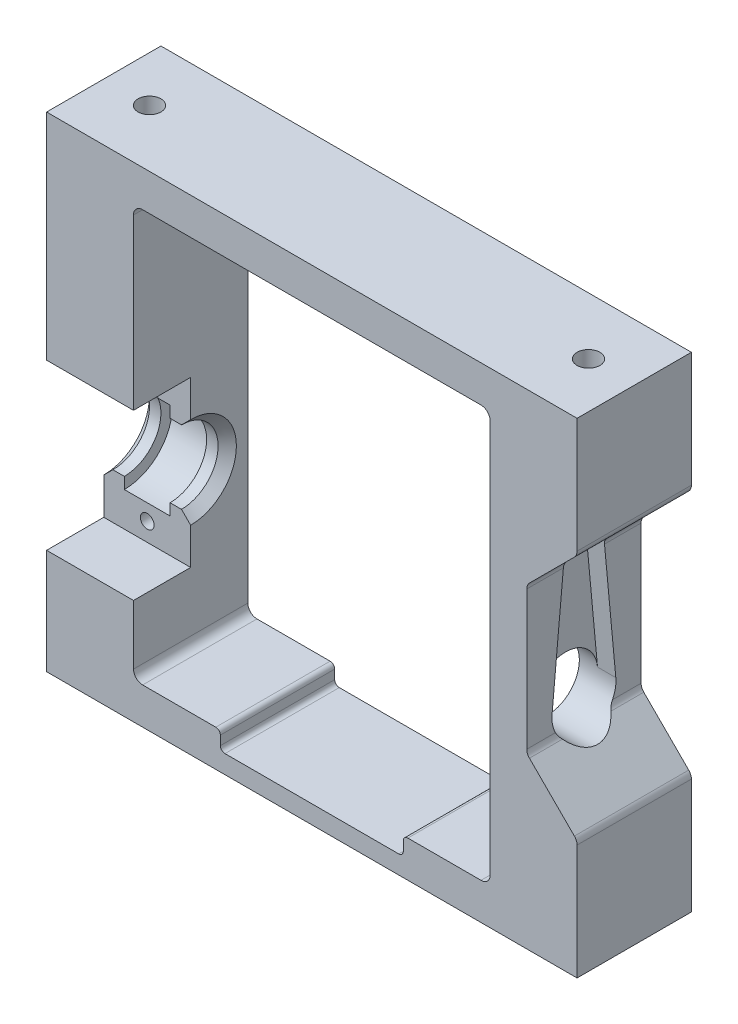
ISO-10303-21;
HEADER;
FILE_DESCRIPTION(('STEP AP214'),'2;1');
FILE_NAME('part.step','',(''),(''),'','','');
FILE_SCHEMA(('AUTOMOTIVE_DESIGN { 1 0 10303 214 1 1 1 1 }'));
ENDSEC;
DATA;
#1=APPLICATION_CONTEXT('core data for automotive mechanical design processes');
#2=APPLICATION_PROTOCOL_DEFINITION('international standard','automotive_design',2000,#1);
#3=PRODUCT_CONTEXT('',#1,'mechanical');
#4=PRODUCT('Part','Part','',(#3));
#5=PRODUCT_RELATED_PRODUCT_CATEGORY('part','',(#4));
#6=PRODUCT_DEFINITION_FORMATION('','',#4);
#7=PRODUCT_DEFINITION_CONTEXT('part definition',#1,'design');
#8=PRODUCT_DEFINITION('design','',#6,#7);
#9=PRODUCT_DEFINITION_SHAPE('','',#8);
#10=(LENGTH_UNIT() NAMED_UNIT(*) SI_UNIT(.MILLI.,.METRE.));
#11=(NAMED_UNIT(*) PLANE_ANGLE_UNIT() SI_UNIT($,.RADIAN.));
#12=(NAMED_UNIT(*) SI_UNIT($,.STERADIAN.) SOLID_ANGLE_UNIT());
#13=UNCERTAINTY_MEASURE_WITH_UNIT(LENGTH_MEASURE(1.E-05),#10,'distance_accuracy_value','');
#14=(GEOMETRIC_REPRESENTATION_CONTEXT(3) GLOBAL_UNCERTAINTY_ASSIGNED_CONTEXT((#13)) GLOBAL_UNIT_ASSIGNED_CONTEXT((#10,
#11,#12)) REPRESENTATION_CONTEXT('',''));
#15=CARTESIAN_POINT('',(0.,0.,0.));
#16=DIRECTION('',(0.,0.,1.));
#17=DIRECTION('',(1.,0.,0.));
#18=AXIS2_PLACEMENT_3D('',#15,#16,#17);
#19=CARTESIAN_POINT('',(0.,0.,12.5));
#20=DIRECTION('',(0.,0.,-1.));
#21=DIRECTION('',(-1.,0.,0.));
#22=AXIS2_PLACEMENT_3D('',#19,#20,#21);
#23=PLANE('',#22);
#24=DIRECTION('',(1.,0.,0.));
#25=VECTOR('',#24,1.);
#26=CARTESIAN_POINT('',(-19.5,-22.5,12.5));
#27=LINE('',#26,#25);
#28=CARTESIAN_POINT('',(10.5,-22.5,12.5));
#29=VERTEX_POINT('',#28);
#30=CARTESIAN_POINT('',(18.5,-22.5,12.5));
#31=VERTEX_POINT('',#30);
#32=EDGE_CURVE('E437',#29,#31,#27,.T.);
#33=ORIENTED_EDGE('',*,*,#32,.F.);
#34=CARTESIAN_POINT('',(10.5,-23.,12.5));
#35=DIRECTION('',(0.,0.,-1.));
#36=DIRECTION('',(-1.,0.,0.));
#37=AXIS2_PLACEMENT_3D('',#34,#35,#36);
#38=CIRCLE('',#37,0.5);
#39=CARTESIAN_POINT('',(10.,-23.,12.5));
#40=VERTEX_POINT('',#39);
#41=EDGE_CURVE('E661',#29,#40,#38,.F.);
#42=ORIENTED_EDGE('',*,*,#41,.T.);
#43=DIRECTION('',(0.,1.,0.));
#44=VECTOR('',#43,1.);
#45=CARTESIAN_POINT('',(10.,-22.5,12.5));
#46=LINE('',#45,#44);
#47=CARTESIAN_POINT('',(10.,-24.,12.5));
#48=VERTEX_POINT('',#47);
#49=EDGE_CURVE('E699',#48,#40,#46,.T.);
#50=ORIENTED_EDGE('',*,*,#49,.F.);
#51=CARTESIAN_POINT('',(9.5,-24.,12.5));
#52=DIRECTION('',(0.,0.,-1.));
#53=DIRECTION('',(-1.,0.,0.));
#54=AXIS2_PLACEMENT_3D('',#51,#52,#53);
#55=CIRCLE('',#54,0.5);
#56=CARTESIAN_POINT('',(9.5,-24.5,12.5));
#57=VERTEX_POINT('',#56);
#58=EDGE_CURVE('E673',#48,#57,#55,.T.);
#59=ORIENTED_EDGE('',*,*,#58,.T.);
#60=DIRECTION('',(1.,0.,0.));
#61=VECTOR('',#60,1.);
#62=CARTESIAN_POINT('',(-10.,-24.5,12.5));
#63=LINE('',#62,#61);
#64=CARTESIAN_POINT('',(-9.5,-24.5,12.5));
#65=VERTEX_POINT('',#64);
#66=EDGE_CURVE('E697',#65,#57,#63,.T.);
#67=ORIENTED_EDGE('',*,*,#66,.F.);
#68=CARTESIAN_POINT('',(-9.5,-24.,12.5));
#69=DIRECTION('',(0.,0.,-1.));
#70=DIRECTION('',(-1.,0.,0.));
#71=AXIS2_PLACEMENT_3D('',#68,#69,#70);
#72=CIRCLE('',#71,0.5);
#73=CARTESIAN_POINT('',(-10.,-24.,12.5));
#74=VERTEX_POINT('',#73);
#75=EDGE_CURVE('E12',#65,#74,#72,.T.);
#76=ORIENTED_EDGE('',*,*,#75,.T.);
#77=DIRECTION('',(0.,-1.,0.));
#78=VECTOR('',#77,1.);
#79=CARTESIAN_POINT('',(-10.,-22.5,12.5));
#80=LINE('',#79,#78);
#81=CARTESIAN_POINT('',(-10.,-23.,12.5));
#82=VERTEX_POINT('',#81);
#83=EDGE_CURVE('E696',#82,#74,#80,.T.);
#84=ORIENTED_EDGE('',*,*,#83,.F.);
#85=CARTESIAN_POINT('',(-10.5,-23.,12.5));
#86=DIRECTION('',(0.,0.,-1.));
#87=DIRECTION('',(-1.,0.,0.));
#88=AXIS2_PLACEMENT_3D('',#85,#86,#87);
#89=CIRCLE('',#88,0.5);
#90=CARTESIAN_POINT('',(-10.5,-22.5,12.5));
#91=VERTEX_POINT('',#90);
#92=EDGE_CURVE('E53',#82,#91,#89,.F.);
#93=ORIENTED_EDGE('',*,*,#92,.T.);
#94=CARTESIAN_POINT('',(-18.5,-22.5,12.5));
#95=VERTEX_POINT('',#94);
#96=EDGE_CURVE('E418',#95,#91,#27,.T.);
#97=ORIENTED_EDGE('',*,*,#96,.F.);
#98=CARTESIAN_POINT('',(-18.5,-21.5,12.5));
#99=DIRECTION('',(0.,0.,-1.));
#100=DIRECTION('',(-1.,0.,0.));
#101=AXIS2_PLACEMENT_3D('',#98,#99,#100);
#102=CIRCLE('',#101,1.);
#103=CARTESIAN_POINT('',(-19.5,-21.5,12.5));
#104=VERTEX_POINT('',#103);
#105=EDGE_CURVE('E632',#95,#104,#102,.T.);
#106=ORIENTED_EDGE('',*,*,#105,.T.);
#107=DIRECTION('',(0.,-1.,0.));
#108=VECTOR('',#107,1.);
#109=CARTESIAN_POINT('',(-19.5,-22.5,12.5));
#110=LINE('',#109,#108);
#111=CARTESIAN_POINT('',(-19.5,-15.,12.5));
#112=VERTEX_POINT('',#111);
#113=EDGE_CURVE('E434',#112,#104,#110,.T.);
#114=ORIENTED_EDGE('',*,*,#113,.F.);
#115=DIRECTION('',(-1.,0.,0.));
#116=VECTOR('',#115,1.);
#117=CARTESIAN_POINT('',(-0.445800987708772,-15.,12.5));
#118=LINE('',#117,#116);
#119=CARTESIAN_POINT('',(-29.,-15.,12.5));
#120=VERTEX_POINT('',#119);
#121=EDGE_CURVE('E779',#112,#120,#118,.T.);
#122=ORIENTED_EDGE('',*,*,#121,.T.);
#123=DIRECTION('',(0.,-1.,0.));
#124=VECTOR('',#123,1.);
#125=CARTESIAN_POINT('',(-29.,-26.5,12.5));
#126=LINE('',#125,#124);
#127=CARTESIAN_POINT('',(-29.,-26.5,12.5));
#128=VERTEX_POINT('',#127);
#129=EDGE_CURVE('E445',#120,#128,#126,.T.);
#130=ORIENTED_EDGE('',*,*,#129,.T.);
#131=DIRECTION('',(1.,0.,0.));
#132=VECTOR('',#131,1.);
#133=CARTESIAN_POINT('',(-29.,-26.5,12.5));
#134=LINE('',#133,#132);
#135=CARTESIAN_POINT('',(29.,-26.5,12.5));
#136=VERTEX_POINT('',#135);
#137=EDGE_CURVE('E449',#128,#136,#134,.T.);
#138=ORIENTED_EDGE('',*,*,#137,.T.);
#139=DIRECTION('',(0.,1.,0.));
#140=VECTOR('',#139,1.);
#141=CARTESIAN_POINT('',(29.,-26.5,12.5));
#142=LINE('',#141,#140);
#143=CARTESIAN_POINT('',(29.,-13.9142135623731,12.5));
#144=VERTEX_POINT('',#143);
#145=EDGE_CURVE('E439',#136,#144,#142,.T.);
#146=ORIENTED_EDGE('',*,*,#145,.T.);
#147=CARTESIAN_POINT('',(28.,-13.9142135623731,12.5));
#148=DIRECTION('',(0.,0.,-1.));
#149=DIRECTION('',(-1.,0.,0.));
#150=AXIS2_PLACEMENT_3D('',#147,#148,#149);
#151=CIRCLE('',#150,1.);
#152=CARTESIAN_POINT('',(28.7071067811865,-13.2071067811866,12.5));
#153=VERTEX_POINT('',#152);
#154=EDGE_CURVE('E509',#144,#153,#151,.F.);
#155=ORIENTED_EDGE('',*,*,#154,.T.);
#156=DIRECTION('',(0.707106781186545,-0.707106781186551,0.));
#157=VECTOR('',#156,1.);
#158=CARTESIAN_POINT('',(23.5,-8.,12.5));
#159=LINE('',#158,#157);
#160=CARTESIAN_POINT('',(23.7928932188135,-8.29289321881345,12.5));
#161=VERTEX_POINT('',#160);
#162=EDGE_CURVE('E711',#161,#153,#159,.T.);
#163=ORIENTED_EDGE('',*,*,#162,.F.);
#164=CARTESIAN_POINT('',(24.5,-7.58578643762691,12.5));
#165=DIRECTION('',(0.,0.,-1.));
#166=DIRECTION('',(-1.,0.,0.));
#167=AXIS2_PLACEMENT_3D('',#164,#165,#166);
#168=CIRCLE('',#167,1.);
#169=CARTESIAN_POINT('',(23.5,-7.58578643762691,12.5));
#170=VERTEX_POINT('',#169);
#171=EDGE_CURVE('E561',#161,#170,#168,.T.);
#172=ORIENTED_EDGE('',*,*,#171,.T.);
#173=DIRECTION('',(0.,-1.,0.));
#174=VECTOR('',#173,1.);
#175=CARTESIAN_POINT('',(23.5,-8.,12.5));
#176=LINE('',#175,#174);
#177=CARTESIAN_POINT('',(23.5,7.58578643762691,12.5));
#178=VERTEX_POINT('',#177);
#179=EDGE_CURVE('E718',#178,#170,#176,.T.);
#180=ORIENTED_EDGE('',*,*,#179,.F.);
#181=CARTESIAN_POINT('',(24.5,7.58578643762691,12.5));
#182=DIRECTION('',(0.,0.,-1.));
#183=DIRECTION('',(-1.,0.,0.));
#184=AXIS2_PLACEMENT_3D('',#181,#182,#183);
#185=CIRCLE('',#184,1.);
#186=CARTESIAN_POINT('',(23.7928932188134,8.29289321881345,12.5));
#187=VERTEX_POINT('',#186);
#188=EDGE_CURVE('E608',#178,#187,#185,.T.);
#189=ORIENTED_EDGE('',*,*,#188,.T.);
#190=DIRECTION('',(-0.707106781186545,-0.707106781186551,0.));
#191=VECTOR('',#190,1.);
#192=CARTESIAN_POINT('',(29.,13.5,12.5));
#193=LINE('',#192,#191);
#194=CARTESIAN_POINT('',(28.7071067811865,13.2071067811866,12.5));
#195=VERTEX_POINT('',#194);
#196=EDGE_CURVE('E705',#195,#187,#193,.T.);
#197=ORIENTED_EDGE('',*,*,#196,.F.);
#198=CARTESIAN_POINT('',(28.,13.9142135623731,12.5));
#199=DIRECTION('',(0.,0.,-1.));
#200=DIRECTION('',(-1.,0.,0.));
#201=AXIS2_PLACEMENT_3D('',#198,#199,#200);
#202=CIRCLE('',#201,1.);
#203=CARTESIAN_POINT('',(29.,13.9142135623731,12.5));
#204=VERTEX_POINT('',#203);
#205=EDGE_CURVE('E507',#195,#204,#202,.F.);
#206=ORIENTED_EDGE('',*,*,#205,.T.);
#207=CARTESIAN_POINT('',(29.,26.5,12.5));
#208=VERTEX_POINT('',#207);
#209=EDGE_CURVE('E443',#204,#208,#142,.T.);
#210=ORIENTED_EDGE('',*,*,#209,.T.);
#211=DIRECTION('',(-1.,0.,0.));
#212=VECTOR('',#211,1.);
#213=CARTESIAN_POINT('',(-29.,26.5,12.5));
#214=LINE('',#213,#212);
#215=CARTESIAN_POINT('',(-29.,26.5,12.5));
#216=VERTEX_POINT('',#215);
#217=EDGE_CURVE('E442',#208,#216,#214,.T.);
#218=ORIENTED_EDGE('',*,*,#217,.T.);
#219=CARTESIAN_POINT('',(-29.,3.,12.5));
#220=VERTEX_POINT('',#219);
#221=EDGE_CURVE('E446',#216,#220,#126,.T.);
#222=ORIENTED_EDGE('',*,*,#221,.T.);
#223=DIRECTION('',(-1.,0.,0.));
#224=VECTOR('',#223,1.);
#225=CARTESIAN_POINT('',(-0.445800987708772,3.,12.5));
#226=LINE('',#225,#224);
#227=CARTESIAN_POINT('',(-19.5,3.,12.5));
#228=VERTEX_POINT('',#227);
#229=EDGE_CURVE('E777',#228,#220,#226,.T.);
#230=ORIENTED_EDGE('',*,*,#229,.F.);
#231=CARTESIAN_POINT('',(-19.5,21.5,12.5));
#232=VERTEX_POINT('',#231);
#233=EDGE_CURVE('E435',#232,#228,#110,.T.);
#234=ORIENTED_EDGE('',*,*,#233,.F.);
#235=CARTESIAN_POINT('',(-18.5,21.5,12.5));
#236=DIRECTION('',(0.,0.,-1.));
#237=DIRECTION('',(-1.,0.,0.));
#238=AXIS2_PLACEMENT_3D('',#235,#236,#237);
#239=CIRCLE('',#238,1.);
#240=CARTESIAN_POINT('',(-18.5,22.5,12.5));
#241=VERTEX_POINT('',#240);
#242=EDGE_CURVE('E636',#232,#241,#239,.T.);
#243=ORIENTED_EDGE('',*,*,#242,.T.);
#244=DIRECTION('',(-1.,0.,0.));
#245=VECTOR('',#244,1.);
#246=CARTESIAN_POINT('',(-19.5,22.5,12.5));
#247=LINE('',#246,#245);
#248=CARTESIAN_POINT('',(18.5,22.5,12.5));
#249=VERTEX_POINT('',#248);
#250=EDGE_CURVE('E431',#249,#241,#247,.T.);
#251=ORIENTED_EDGE('',*,*,#250,.F.);
#252=CARTESIAN_POINT('',(18.5,21.5,12.5));
#253=DIRECTION('',(0.,0.,-1.));
#254=DIRECTION('',(-1.,0.,0.));
#255=AXIS2_PLACEMENT_3D('',#252,#253,#254);
#256=CIRCLE('',#255,1.);
#257=CARTESIAN_POINT('',(19.5,21.5,12.5));
#258=VERTEX_POINT('',#257);
#259=EDGE_CURVE('E640',#249,#258,#256,.T.);
#260=ORIENTED_EDGE('',*,*,#259,.T.);
#261=DIRECTION('',(0.,1.,0.));
#262=VECTOR('',#261,1.);
#263=CARTESIAN_POINT('',(19.5,-22.5,12.5));
#264=LINE('',#263,#262);
#265=CARTESIAN_POINT('',(19.5,-21.5,12.5));
#266=VERTEX_POINT('',#265);
#267=EDGE_CURVE('E411',#266,#258,#264,.T.);
#268=ORIENTED_EDGE('',*,*,#267,.F.);
#269=CARTESIAN_POINT('',(18.5,-21.5,12.5));
#270=DIRECTION('',(0.,0.,-1.));
#271=DIRECTION('',(-1.,0.,0.));
#272=AXIS2_PLACEMENT_3D('',#269,#270,#271);
#273=CIRCLE('',#272,1.);
#274=EDGE_CURVE('E627',#266,#31,#273,.T.);
#275=ORIENTED_EDGE('',*,*,#274,.T.);
#276=EDGE_LOOP('',(#33,#42,#50,#59,#67,#76,#84,#93,#97,#106,#114,#122,#130,#138,#146,#155,#163,
#172,#180,#189,#197,#206,#210,#218,#222,#230,#234,#243,#251,#260,#268,#275));
#277=FACE_BOUND('',#276,.T.);
#278=ADVANCED_FACE('F38',(#277),#23,.F.);
#279=CARTESIAN_POINT('',(0.,0.,0.));
#280=DIRECTION('',(0.,0.,-1.));
#281=DIRECTION('',(-1.,0.,0.));
#282=AXIS2_PLACEMENT_3D('',#279,#280,#281);
#283=PLANE('',#282);
#284=DIRECTION('',(0.707106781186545,-0.707106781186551,0.));
#285=VECTOR('',#284,1.);
#286=CARTESIAN_POINT('',(23.5,-8.,0.));
#287=LINE('',#286,#285);
#288=CARTESIAN_POINT('',(23.7928932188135,-8.29289321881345,0.));
#289=VERTEX_POINT('',#288);
#290=CARTESIAN_POINT('',(28.7071067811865,-13.2071067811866,0.));
#291=VERTEX_POINT('',#290);
#292=EDGE_CURVE('E355',#289,#291,#287,.T.);
#293=ORIENTED_EDGE('',*,*,#292,.T.);
#294=CARTESIAN_POINT('',(28.,-13.9142135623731,0.));
#295=DIRECTION('',(0.,0.,-1.));
#296=DIRECTION('',(-1.,0.,0.));
#297=AXIS2_PLACEMENT_3D('',#294,#295,#296);
#298=CIRCLE('',#297,1.);
#299=CARTESIAN_POINT('',(29.,-13.9142135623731,0.));
#300=VERTEX_POINT('',#299);
#301=EDGE_CURVE('E521',#291,#300,#298,.T.);
#302=ORIENTED_EDGE('',*,*,#301,.T.);
#303=DIRECTION('',(0.,1.,0.));
#304=VECTOR('',#303,1.);
#305=CARTESIAN_POINT('',(29.,-26.5,0.));
#306=LINE('',#305,#304);
#307=CARTESIAN_POINT('',(29.,-26.5,0.));
#308=VERTEX_POINT('',#307);
#309=EDGE_CURVE('E452',#308,#300,#306,.T.);
#310=ORIENTED_EDGE('',*,*,#309,.F.);
#311=DIRECTION('',(1.,0.,0.));
#312=VECTOR('',#311,1.);
#313=CARTESIAN_POINT('',(-29.,-26.5,0.));
#314=LINE('',#313,#312);
#315=CARTESIAN_POINT('',(-29.,-26.5,0.));
#316=VERTEX_POINT('',#315);
#317=EDGE_CURVE('E459',#316,#308,#314,.T.);
#318=ORIENTED_EDGE('',*,*,#317,.F.);
#319=DIRECTION('',(0.,-1.,0.));
#320=VECTOR('',#319,1.);
#321=CARTESIAN_POINT('',(-29.,-26.5,0.));
#322=LINE('',#321,#320);
#323=CARTESIAN_POINT('',(-29.,26.5,0.));
#324=VERTEX_POINT('',#323);
#325=EDGE_CURVE('E457',#324,#316,#322,.T.);
#326=ORIENTED_EDGE('',*,*,#325,.F.);
#327=DIRECTION('',(-1.,0.,0.));
#328=VECTOR('',#327,1.);
#329=CARTESIAN_POINT('',(-29.,26.5,0.));
#330=LINE('',#329,#328);
#331=CARTESIAN_POINT('',(29.,26.5,0.));
#332=VERTEX_POINT('',#331);
#333=EDGE_CURVE('E455',#332,#324,#330,.T.);
#334=ORIENTED_EDGE('',*,*,#333,.F.);
#335=CARTESIAN_POINT('',(29.,13.9142135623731,0.));
#336=VERTEX_POINT('',#335);
#337=EDGE_CURVE('E428',#336,#332,#306,.T.);
#338=ORIENTED_EDGE('',*,*,#337,.F.);
#339=CARTESIAN_POINT('',(28.,13.9142135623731,0.));
#340=DIRECTION('',(0.,0.,-1.));
#341=DIRECTION('',(-1.,0.,0.));
#342=AXIS2_PLACEMENT_3D('',#339,#340,#341);
#343=CIRCLE('',#342,1.);
#344=CARTESIAN_POINT('',(28.7071067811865,13.2071067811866,0.));
#345=VERTEX_POINT('',#344);
#346=EDGE_CURVE('E519',#336,#345,#343,.T.);
#347=ORIENTED_EDGE('',*,*,#346,.T.);
#348=DIRECTION('',(-0.707106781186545,-0.707106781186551,0.));
#349=VECTOR('',#348,1.);
#350=CARTESIAN_POINT('',(29.,13.5,0.));
#351=LINE('',#350,#349);
#352=CARTESIAN_POINT('',(23.7928932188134,8.29289321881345,0.));
#353=VERTEX_POINT('',#352);
#354=EDGE_CURVE('E707',#345,#353,#351,.T.);
#355=ORIENTED_EDGE('',*,*,#354,.T.);
#356=CARTESIAN_POINT('',(24.5,7.58578643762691,0.));
#357=DIRECTION('',(0.,0.,-1.));
#358=DIRECTION('',(-1.,0.,0.));
#359=AXIS2_PLACEMENT_3D('',#356,#357,#358);
#360=CIRCLE('',#359,1.);
#361=CARTESIAN_POINT('',(23.5,7.58578643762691,0.));
#362=VERTEX_POINT('',#361);
#363=EDGE_CURVE('E624',#353,#362,#360,.F.);
#364=ORIENTED_EDGE('',*,*,#363,.T.);
#365=DIRECTION('',(0.,-1.,0.));
#366=VECTOR('',#365,1.);
#367=CARTESIAN_POINT('',(23.5,-8.,0.));
#368=LINE('',#367,#366);
#369=CARTESIAN_POINT('',(23.5,-7.58578643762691,0.));
#370=VERTEX_POINT('',#369);
#371=EDGE_CURVE('E710',#362,#370,#368,.T.);
#372=ORIENTED_EDGE('',*,*,#371,.T.);
#373=CARTESIAN_POINT('',(24.5,-7.58578643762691,0.));
#374=DIRECTION('',(0.,0.,-1.));
#375=DIRECTION('',(-1.,0.,0.));
#376=AXIS2_PLACEMENT_3D('',#373,#374,#375);
#377=CIRCLE('',#376,1.);
#378=EDGE_CURVE('E808',#370,#289,#377,.F.);
#379=ORIENTED_EDGE('',*,*,#378,.T.);
#380=EDGE_LOOP('',(#293,#302,#310,#318,#326,#334,#338,#347,#355,#364,#372,#379));
#381=FACE_BOUND('',#380,.T.);
#382=CARTESIAN_POINT('',(-24.25,-13.,0.));
#383=DIRECTION('',(0.,0.,1.));
#384=DIRECTION('',(1.,0.,0.));
#385=AXIS2_PLACEMENT_3D('',#382,#383,#384);
#386=CIRCLE('',#385,0.750000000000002);
#387=CARTESIAN_POINT('',(-23.5,-13.,0.));
#388=VERTEX_POINT('',#387);
#389=EDGE_CURVE('E730',#388,#388,#386,.T.);
#390=ORIENTED_EDGE('',*,*,#389,.T.);
#391=EDGE_LOOP('',(#390));
#392=FACE_BOUND('',#391,.T.);
#393=CARTESIAN_POINT('',(-24.25,0.999999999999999,0.));
#394=DIRECTION('',(0.,0.,1.));
#395=DIRECTION('',(1.,0.,0.));
#396=AXIS2_PLACEMENT_3D('',#393,#394,#395);
#397=CIRCLE('',#396,0.750000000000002);
#398=CARTESIAN_POINT('',(-23.5,0.999999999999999,0.));
#399=VERTEX_POINT('',#398);
#400=EDGE_CURVE('E736',#399,#399,#397,.T.);
#401=ORIENTED_EDGE('',*,*,#400,.T.);
#402=EDGE_LOOP('',(#401));
#403=FACE_BOUND('',#402,.T.);
#404=DIRECTION('',(0.,1.,0.));
#405=VECTOR('',#404,1.);
#406=CARTESIAN_POINT('',(10.,-22.5,0.));
#407=LINE('',#406,#405);
#408=CARTESIAN_POINT('',(10.,-24.,0.));
#409=VERTEX_POINT('',#408);
#410=CARTESIAN_POINT('',(10.,-23.,0.));
#411=VERTEX_POINT('',#410);
#412=EDGE_CURVE('E690',#409,#411,#407,.T.);
#413=ORIENTED_EDGE('',*,*,#412,.T.);
#414=CARTESIAN_POINT('',(10.5,-23.,0.));
#415=DIRECTION('',(0.,0.,-1.));
#416=DIRECTION('',(-1.,0.,0.));
#417=AXIS2_PLACEMENT_3D('',#414,#415,#416);
#418=CIRCLE('',#417,0.5);
#419=CARTESIAN_POINT('',(10.5,-22.5,0.));
#420=VERTEX_POINT('',#419);
#421=EDGE_CURVE('E656',#411,#420,#418,.T.);
#422=ORIENTED_EDGE('',*,*,#421,.T.);
#423=DIRECTION('',(1.,0.,0.));
#424=VECTOR('',#423,1.);
#425=CARTESIAN_POINT('',(-19.5,-22.5,0.));
#426=LINE('',#425,#424);
#427=CARTESIAN_POINT('',(18.5,-22.5,0.));
#428=VERTEX_POINT('',#427);
#429=EDGE_CURVE('E424',#420,#428,#426,.T.);
#430=ORIENTED_EDGE('',*,*,#429,.T.);
#431=CARTESIAN_POINT('',(18.5,-21.5,0.));
#432=DIRECTION('',(0.,0.,-1.));
#433=DIRECTION('',(-1.,0.,0.));
#434=AXIS2_PLACEMENT_3D('',#431,#432,#433);
#435=CIRCLE('',#434,1.);
#436=CARTESIAN_POINT('',(19.5,-21.5,0.));
#437=VERTEX_POINT('',#436);
#438=EDGE_CURVE('E630',#428,#437,#435,.F.);
#439=ORIENTED_EDGE('',*,*,#438,.T.);
#440=DIRECTION('',(0.,1.,0.));
#441=VECTOR('',#440,1.);
#442=CARTESIAN_POINT('',(19.5,-22.5,0.));
#443=LINE('',#442,#441);
#444=CARTESIAN_POINT('',(19.5,21.5,0.));
#445=VERTEX_POINT('',#444);
#446=EDGE_CURVE('E414',#437,#445,#443,.T.);
#447=ORIENTED_EDGE('',*,*,#446,.T.);
#448=CARTESIAN_POINT('',(18.5,21.5,0.));
#449=DIRECTION('',(0.,0.,-1.));
#450=DIRECTION('',(-1.,0.,0.));
#451=AXIS2_PLACEMENT_3D('',#448,#449,#450);
#452=CIRCLE('',#451,1.);
#453=CARTESIAN_POINT('',(18.5,22.5,0.));
#454=VERTEX_POINT('',#453);
#455=EDGE_CURVE('E642',#445,#454,#452,.F.);
#456=ORIENTED_EDGE('',*,*,#455,.T.);
#457=DIRECTION('',(-1.,0.,0.));
#458=VECTOR('',#457,1.);
#459=CARTESIAN_POINT('',(-19.5,22.5,0.));
#460=LINE('',#459,#458);
#461=CARTESIAN_POINT('',(-18.5,22.5,0.));
#462=VERTEX_POINT('',#461);
#463=EDGE_CURVE('E417',#454,#462,#460,.T.);
#464=ORIENTED_EDGE('',*,*,#463,.T.);
#465=CARTESIAN_POINT('',(-18.5,21.5,0.));
#466=DIRECTION('',(0.,0.,-1.));
#467=DIRECTION('',(-1.,0.,0.));
#468=AXIS2_PLACEMENT_3D('',#465,#466,#467);
#469=CIRCLE('',#468,1.);
#470=CARTESIAN_POINT('',(-19.5,21.5,0.));
#471=VERTEX_POINT('',#470);
#472=EDGE_CURVE('E638',#462,#471,#469,.F.);
#473=ORIENTED_EDGE('',*,*,#472,.T.);
#474=DIRECTION('',(0.,-1.,0.));
#475=VECTOR('',#474,1.);
#476=CARTESIAN_POINT('',(-19.5,-22.5,0.));
#477=LINE('',#476,#475);
#478=CARTESIAN_POINT('',(-19.5,-21.5,0.));
#479=VERTEX_POINT('',#478);
#480=EDGE_CURVE('E421',#471,#479,#477,.T.);
#481=ORIENTED_EDGE('',*,*,#480,.T.);
#482=CARTESIAN_POINT('',(-18.5,-21.5,0.));
#483=DIRECTION('',(0.,0.,-1.));
#484=DIRECTION('',(-1.,0.,0.));
#485=AXIS2_PLACEMENT_3D('',#482,#483,#484);
#486=CIRCLE('',#485,1.);
#487=CARTESIAN_POINT('',(-18.5,-22.5,0.));
#488=VERTEX_POINT('',#487);
#489=EDGE_CURVE('E634',#479,#488,#486,.F.);
#490=ORIENTED_EDGE('',*,*,#489,.T.);
#491=CARTESIAN_POINT('',(-10.5,-22.5,0.));
#492=VERTEX_POINT('',#491);
#493=EDGE_CURVE('E425',#488,#492,#426,.T.);
#494=ORIENTED_EDGE('',*,*,#493,.T.);
#495=CARTESIAN_POINT('',(-10.5,-23.,0.));
#496=DIRECTION('',(0.,0.,-1.));
#497=DIRECTION('',(-1.,0.,0.));
#498=AXIS2_PLACEMENT_3D('',#495,#496,#497);
#499=CIRCLE('',#498,0.5);
#500=CARTESIAN_POINT('',(-10.,-23.,0.));
#501=VERTEX_POINT('',#500);
#502=EDGE_CURVE('E654',#492,#501,#499,.T.);
#503=ORIENTED_EDGE('',*,*,#502,.T.);
#504=DIRECTION('',(0.,-1.,0.));
#505=VECTOR('',#504,1.);
#506=CARTESIAN_POINT('',(-10.,-22.5,0.));
#507=LINE('',#506,#505);
#508=CARTESIAN_POINT('',(-10.,-24.,0.));
#509=VERTEX_POINT('',#508);
#510=EDGE_CURVE('E682',#501,#509,#507,.T.);
#511=ORIENTED_EDGE('',*,*,#510,.T.);
#512=CARTESIAN_POINT('',(-9.5,-24.,0.));
#513=DIRECTION('',(0.,0.,-1.));
#514=DIRECTION('',(-1.,0.,0.));
#515=AXIS2_PLACEMENT_3D('',#512,#513,#514);
#516=CIRCLE('',#515,0.5);
#517=CARTESIAN_POINT('',(-9.5,-24.5,0.));
#518=VERTEX_POINT('',#517);
#519=EDGE_CURVE('E46',#509,#518,#516,.F.);
#520=ORIENTED_EDGE('',*,*,#519,.T.);
#521=DIRECTION('',(1.,0.,0.));
#522=VECTOR('',#521,1.);
#523=CARTESIAN_POINT('',(-10.,-24.5,0.));
#524=LINE('',#523,#522);
#525=CARTESIAN_POINT('',(9.5,-24.5,0.));
#526=VERTEX_POINT('',#525);
#527=EDGE_CURVE('E680',#518,#526,#524,.T.);
#528=ORIENTED_EDGE('',*,*,#527,.T.);
#529=CARTESIAN_POINT('',(9.5,-24.,0.));
#530=DIRECTION('',(0.,0.,-1.));
#531=DIRECTION('',(-1.,0.,0.));
#532=AXIS2_PLACEMENT_3D('',#529,#530,#531);
#533=CIRCLE('',#532,0.5);
#534=EDGE_CURVE('E671',#526,#409,#533,.F.);
#535=ORIENTED_EDGE('',*,*,#534,.T.);
#536=EDGE_LOOP('',(#413,#422,#430,#439,#447,#456,#464,#473,#481,#490,#494,#503,#511,#520,#528,#535));
#537=FACE_BOUND('',#536,.T.);
#538=ADVANCED_FACE('F679',(#381,#392,#403,#537),#283,.T.);
#539=CARTESIAN_POINT('',(-19.5,-22.5,0.));
#540=DIRECTION('',(0.,-1.,0.));
#541=DIRECTION('',(0.,0.,-1.));
#542=AXIS2_PLACEMENT_3D('',#539,#540,#541);
#543=PLANE('',#542);
#544=ORIENTED_EDGE('',*,*,#96,.T.);
#545=DIRECTION('',(0.,0.,-1.));
#546=VECTOR('',#545,1.);
#547=CARTESIAN_POINT('',(-10.5,-22.5,0.));
#548=LINE('',#547,#546);
#549=EDGE_CURVE('E668',#91,#492,#548,.T.);
#550=ORIENTED_EDGE('',*,*,#549,.T.);
#551=ORIENTED_EDGE('',*,*,#493,.F.);
#552=DIRECTION('',(0.,0.,1.));
#553=VECTOR('',#552,1.);
#554=CARTESIAN_POINT('',(-18.5,-22.5,12.5));
#555=LINE('',#554,#553);
#556=EDGE_CURVE('E545',#488,#95,#555,.T.);
#557=ORIENTED_EDGE('',*,*,#556,.T.);
#558=EDGE_LOOP('',(#544,#550,#551,#557));
#559=FACE_BOUND('',#558,.T.);
#560=ADVANCED_FACE('F839',(#559),#543,.F.);
#561=ORIENTED_EDGE('',*,*,#429,.F.);
#562=DIRECTION('',(0.,0.,-1.));
#563=VECTOR('',#562,1.);
#564=CARTESIAN_POINT('',(10.5,-22.5,12.5));
#565=LINE('',#564,#563);
#566=EDGE_CURVE('E658',#420,#29,#565,.F.);
#567=ORIENTED_EDGE('',*,*,#566,.T.);
#568=ORIENTED_EDGE('',*,*,#32,.T.);
#569=DIRECTION('',(0.,0.,1.));
#570=VECTOR('',#569,1.);
#571=CARTESIAN_POINT('',(18.5,-22.5,0.));
#572=LINE('',#571,#570);
#573=EDGE_CURVE('E548',#31,#428,#572,.F.);
#574=ORIENTED_EDGE('',*,*,#573,.T.);
#575=EDGE_LOOP('',(#561,#567,#568,#574));
#576=FACE_BOUND('',#575,.T.);
#577=ADVANCED_FACE('F1004',(#576),#543,.F.);
#578=CARTESIAN_POINT('',(29.,-26.5,12.5));
#579=DIRECTION('',(-1.,0.,0.));
#580=DIRECTION('',(0.,0.,1.));
#581=AXIS2_PLACEMENT_3D('',#578,#579,#580);
#582=PLANE('',#581);
#583=ORIENTED_EDGE('',*,*,#209,.F.);
#584=DIRECTION('',(0.,0.,1.));
#585=VECTOR('',#584,1.);
#586=CARTESIAN_POINT('',(29.,13.9142135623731,12.5));
#587=LINE('',#586,#585);
#588=EDGE_CURVE('E538',#204,#336,#587,.F.);
#589=ORIENTED_EDGE('',*,*,#588,.T.);
#590=ORIENTED_EDGE('',*,*,#337,.T.);
#591=DIRECTION('',(0.,0.,-1.));
#592=VECTOR('',#591,1.);
#593=CARTESIAN_POINT('',(29.,26.5,12.5));
#594=LINE('',#593,#592);
#595=EDGE_CURVE('E469',#208,#332,#594,.T.);
#596=ORIENTED_EDGE('',*,*,#595,.F.);
#597=EDGE_LOOP('',(#583,#589,#590,#596));
#598=FACE_BOUND('',#597,.T.);
#599=ADVANCED_FACE('F862',(#598),#582,.F.);
#600=CARTESIAN_POINT('',(-8.18629150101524,-6.,6.25));
#601=DIRECTION('',(-1.,0.,0.));
#602=DIRECTION('',(0.,0.,1.));
#603=AXIS2_PLACEMENT_3D('',#600,#601,#602);
#604=CYLINDRICAL_SURFACE('',#603,4.);
#605=DIRECTION('',(-1.,0.,0.));
#606=VECTOR('',#605,1.);
#607=CARTESIAN_POINT('',(-8.18629150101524,-10.,6.25));
#608=LINE('',#607,#606);
#609=CARTESIAN_POINT('',(-21.75,-10.,6.25));
#610=VERTEX_POINT('',#609);
#611=CARTESIAN_POINT('',(-20.5,-10.,6.25));
#612=VERTEX_POINT('',#611);
#613=EDGE_CURVE('E477',#610,#612,#608,.F.);
#614=ORIENTED_EDGE('',*,*,#613,.T.);
#615=CARTESIAN_POINT('',(-20.5,-6.,6.25));
#616=DIRECTION('',(-1.,0.,0.));
#617=DIRECTION('',(0.,0.,1.));
#618=AXIS2_PLACEMENT_3D('',#615,#616,#617);
#619=CIRCLE('',#618,4.);
#620=CARTESIAN_POINT('',(-20.5,-2.,6.25));
#621=VERTEX_POINT('',#620);
#622=EDGE_CURVE('E499',#612,#621,#619,.F.);
#623=ORIENTED_EDGE('',*,*,#622,.T.);
#624=DIRECTION('',(-1.,0.,0.));
#625=VECTOR('',#624,1.);
#626=CARTESIAN_POINT('',(-8.18629150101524,-2.,6.25));
#627=LINE('',#626,#625);
#628=CARTESIAN_POINT('',(-21.75,-2.,6.25));
#629=VERTEX_POINT('',#628);
#630=EDGE_CURVE('E475',#621,#629,#627,.T.);
#631=ORIENTED_EDGE('',*,*,#630,.T.);
#632=CARTESIAN_POINT('',(-21.75,-6.,6.25));
#633=DIRECTION('',(-1.,0.,0.));
#634=DIRECTION('',(0.,0.,1.));
#635=AXIS2_PLACEMENT_3D('',#632,#633,#634);
#636=CIRCLE('',#635,4.);
#637=EDGE_CURVE('E746',#610,#629,#636,.F.);
#638=ORIENTED_EDGE('',*,*,#637,.F.);
#639=EDGE_LOOP('',(#614,#623,#631,#638));
#640=FACE_BOUND('',#639,.T.);
#641=ADVANCED_FACE('F886',(#640),#604,.F.);
#642=CARTESIAN_POINT('',(-29.,-6.,6.25));
#643=DIRECTION('',(1.,0.,0.));
#644=DIRECTION('',(0.,0.,-1.));
#645=AXIS2_PLACEMENT_3D('',#642,#643,#644);
#646=CYLINDRICAL_SURFACE('',#645,3.5);
#647=CARTESIAN_POINT('',(19.5,-6.,6.25));
#648=DIRECTION('',(1.,0.,0.));
#649=DIRECTION('',(0.,0.,-1.));
#650=AXIS2_PLACEMENT_3D('',#647,#648,#649);
#651=CIRCLE('',#650,3.5);
#652=CARTESIAN_POINT('',(19.5,-6.,2.75));
#653=VERTEX_POINT('',#652);
#654=EDGE_CURVE('E385',#653,#653,#651,.T.);
#655=ORIENTED_EDGE('',*,*,#654,.F.);
#656=EDGE_LOOP('',(#655));
#657=FACE_BOUND('',#656,.T.);
#658=CARTESIAN_POINT('',(23.5,-6.,6.25));
#659=DIRECTION('',(-1.,0.,0.));
#660=DIRECTION('',(0.,-1.,0.));
#661=AXIS2_PLACEMENT_3D('',#658,#659,#660);
#662=CIRCLE('',#661,3.5);
#663=CARTESIAN_POINT('',(23.5,-5.675,9.73487804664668));
#664=VERTEX_POINT('',#663);
#665=CARTESIAN_POINT('',(23.5,-7.58578643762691,9.37014124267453));
#666=VERTEX_POINT('',#665);
#667=EDGE_CURVE('E357',#664,#666,#662,.F.);
#668=ORIENTED_EDGE('',*,*,#667,.T.);
#669=CARTESIAN_POINT('',(23.5,-7.58578643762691,9.37014124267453));
#670=CARTESIAN_POINT('',(23.5000003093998,-7.62460467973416,9.35042367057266));
#671=CARTESIAN_POINT('',(23.5022593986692,-7.66302077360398,9.32997659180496));
#672=CARTESIAN_POINT('',(23.5110222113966,-7.73866086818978,9.28791210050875));
#673=CARTESIAN_POINT('',(23.5175213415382,-7.77588611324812,9.2662959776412));
#674=CARTESIAN_POINT('',(23.5342344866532,-7.84773312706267,9.22280954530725));
#675=CARTESIAN_POINT('',(23.5443295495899,-7.88239964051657,9.20096694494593));
#676=CARTESIAN_POINT('',(23.5680313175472,-7.95009569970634,9.15667588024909));
#677=CARTESIAN_POINT('',(23.5816384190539,-7.98312506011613,9.13422734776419));
#678=CARTESIAN_POINT('',(23.6210569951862,-8.06601350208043,9.07585030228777));
#679=CARTESIAN_POINT('',(23.6493706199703,-8.11452900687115,9.03965142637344));
#680=CARTESIAN_POINT('',(23.6980853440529,-8.18391656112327,8.98521618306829));
#681=CARTESIAN_POINT('',(23.71561893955,-8.2067388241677,8.96682241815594));
#682=CARTESIAN_POINT('',(23.752727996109,-8.25092848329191,8.9303251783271));
#683=CARTESIAN_POINT('',(23.7723042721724,-8.27229529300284,8.91222182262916));
#684=CARTESIAN_POINT('',(23.7928932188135,-8.29289321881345,8.89436016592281));
#685=B_SPLINE_CURVE_WITH_KNOTS('',3,(#669,#670,#671,#672,#673,#674,#675,#676,#677,#678,#679,
#680,#681,#682,#683,#684),.UNSPECIFIED.,.F.,.F.,(4,2,2,2,2,2,2,4),(0.,0.13050978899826,
0.260878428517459,0.387283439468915,0.513702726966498,0.71340833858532,0.815798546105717,
0.918229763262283),.UNSPECIFIED.);
#686=CARTESIAN_POINT('',(23.7928932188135,-8.29289321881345,8.89436016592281));
#687=VERTEX_POINT('',#686);
#688=EDGE_CURVE('E563',#666,#687,#685,.T.);
#689=ORIENTED_EDGE('',*,*,#688,.T.);
#690=CARTESIAN_POINT('',(21.5,-6.,6.25));
#691=DIRECTION('',(-0.707106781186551,-0.707106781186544,0.));
#692=DIRECTION('',(0.707106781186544,-0.707106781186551,0.));
#693=AXIS2_PLACEMENT_3D('',#690,#691,#692);
#694=ELLIPSE('',#693,4.94974746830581,3.5);
#695=CARTESIAN_POINT('',(23.7928932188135,-8.29289321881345,3.6056398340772));
#696=VERTEX_POINT('',#695);
#697=EDGE_CURVE('E727',#687,#696,#694,.F.);
#698=ORIENTED_EDGE('',*,*,#697,.T.);
#699=CARTESIAN_POINT('',(23.7928932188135,-8.29289321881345,3.6056398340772));
#700=CARTESIAN_POINT('',(23.7668105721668,-8.26679405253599,3.5830014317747));
#701=CARTESIAN_POINT('',(23.7423346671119,-8.23944596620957,3.55997300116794));
#702=CARTESIAN_POINT('',(23.6966609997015,-8.18243306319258,3.51351929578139));
#703=CARTESIAN_POINT('',(23.6754638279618,-8.15276783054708,3.49009395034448));
#704=CARTESIAN_POINT('',(23.6370256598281,-8.09226193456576,3.44396286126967));
#705=CARTESIAN_POINT('',(23.6196825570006,-8.06148603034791,3.42125727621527));
#706=CARTESIAN_POINT('',(23.5882795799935,-7.99811854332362,3.37614588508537));
#707=CARTESIAN_POINT('',(23.574219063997,-7.96552731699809,3.35374002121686));
#708=CARTESIAN_POINT('',(23.5421684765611,-7.87869190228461,3.29625673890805));
#709=CARTESIAN_POINT('',(23.5268418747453,-7.82313417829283,3.26159799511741));
#710=CARTESIAN_POINT('',(23.5110030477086,-7.73669751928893,3.21107894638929));
#711=CARTESIAN_POINT('',(23.5069112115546,-7.70697545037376,3.19428320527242));
#712=CARTESIAN_POINT('',(23.5014100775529,-7.64684975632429,3.16146285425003));
#713=CARTESIAN_POINT('',(23.5000019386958,-7.61644584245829,3.14543858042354));
#714=CARTESIAN_POINT('',(23.5,-7.58578643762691,3.12985875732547));
#715=B_SPLINE_CURVE_WITH_KNOTS('',3,(#699,#700,#701,#702,#703,#704,#705,#706,#707,#708,#709,
#710,#711,#712,#713,#714),.UNSPECIFIED.,.F.,.F.,(4,2,2,2,2,2,2,4),(0.,0.129802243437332,
0.259627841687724,0.385436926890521,0.511221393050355,0.712080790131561,0.815129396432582,
0.918222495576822),.UNSPECIFIED.);
#716=CARTESIAN_POINT('',(23.5,-7.58578643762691,3.12985875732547));
#717=VERTEX_POINT('',#716);
#718=EDGE_CURVE('E351',#696,#717,#715,.T.);
#719=ORIENTED_EDGE('',*,*,#718,.T.);
#720=CARTESIAN_POINT('',(23.5,-5.675,2.76512195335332));
#721=VERTEX_POINT('',#720);
#722=EDGE_CURVE('E343',#717,#721,#662,.F.);
#723=ORIENTED_EDGE('',*,*,#722,.T.);
#724=DIRECTION('',(1.,0.,0.));
#725=VECTOR('',#724,1.);
#726=CARTESIAN_POINT('',(-1.40669749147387,-5.675,2.76512195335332));
#727=LINE('',#726,#725);
#728=CARTESIAN_POINT('',(21.5,-5.675,2.76512195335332));
#729=VERTEX_POINT('',#728);
#730=EDGE_CURVE('E349',#729,#721,#727,.T.);
#731=ORIENTED_EDGE('',*,*,#730,.F.);
#732=CARTESIAN_POINT('',(21.5,-6.,6.25));
#733=DIRECTION('',(1.,0.,0.));
#734=DIRECTION('',(0.,0.,-1.));
#735=AXIS2_PLACEMENT_3D('',#732,#733,#734);
#736=CIRCLE('',#735,3.5);
#737=CARTESIAN_POINT('',(21.5,-5.675,9.73487804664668));
#738=VERTEX_POINT('',#737);
#739=EDGE_CURVE('E472',#738,#729,#736,.F.);
#740=ORIENTED_EDGE('',*,*,#739,.F.);
#741=DIRECTION('',(1.,0.,0.));
#742=VECTOR('',#741,1.);
#743=CARTESIAN_POINT('',(-1.40669749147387,-5.675,9.73487804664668));
#744=LINE('',#743,#742);
#745=EDGE_CURVE('E786',#738,#664,#744,.T.);
#746=ORIENTED_EDGE('',*,*,#745,.T.);
#747=EDGE_LOOP('',(#668,#689,#698,#719,#723,#731,#740,#746));
#748=FACE_BOUND('',#747,.T.);
#749=ADVANCED_FACE('F346',(#657,#748),#646,.F.);
#750=ORIENTED_EDGE('',*,*,#309,.T.);
#751=DIRECTION('',(0.,0.,1.));
#752=VECTOR('',#751,1.);
#753=CARTESIAN_POINT('',(29.,-13.9142135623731,12.5));
#754=LINE('',#753,#752);
#755=EDGE_CURVE('E504',#300,#144,#754,.T.);
#756=ORIENTED_EDGE('',*,*,#755,.T.);
#757=ORIENTED_EDGE('',*,*,#145,.F.);
#758=DIRECTION('',(0.,0.,-1.));
#759=VECTOR('',#758,1.);
#760=CARTESIAN_POINT('',(29.,-26.5,12.5));
#761=LINE('',#760,#759);
#762=EDGE_CURVE('E451',#136,#308,#761,.T.);
#763=ORIENTED_EDGE('',*,*,#762,.T.);
#764=EDGE_LOOP('',(#750,#756,#757,#763));
#765=FACE_BOUND('',#764,.T.);
#766=ADVANCED_FACE('F857',(#765),#582,.F.);
#767=CARTESIAN_POINT('',(-29.,26.5,12.5));
#768=DIRECTION('',(0.,-1.,0.));
#769=DIRECTION('',(0.,0.,-1.));
#770=AXIS2_PLACEMENT_3D('',#767,#768,#769);
#771=PLANE('',#770);
#772=CARTESIAN_POINT('',(24.,26.5,6.25000000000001));
#773=DIRECTION('',(0.,-1.,0.));
#774=DIRECTION('',(0.,0.,-1.));
#775=AXIS2_PLACEMENT_3D('',#772,#773,#774);
#776=CIRCLE('',#775,1.25);
#777=CARTESIAN_POINT('',(24.,26.5,5.00000000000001));
#778=VERTEX_POINT('',#777);
#779=EDGE_CURVE('E389',#778,#778,#776,.T.);
#780=ORIENTED_EDGE('',*,*,#779,.T.);
#781=EDGE_LOOP('',(#780));
#782=FACE_BOUND('',#781,.T.);
#783=CARTESIAN_POINT('',(-24.,26.5,6.25));
#784=DIRECTION('',(0.,-1.,0.));
#785=DIRECTION('',(0.,0.,-1.));
#786=AXIS2_PLACEMENT_3D('',#783,#784,#785);
#787=CIRCLE('',#786,1.25);
#788=CARTESIAN_POINT('',(-24.,26.5,5.));
#789=VERTEX_POINT('',#788);
#790=EDGE_CURVE('E393',#789,#789,#787,.T.);
#791=ORIENTED_EDGE('',*,*,#790,.T.);
#792=EDGE_LOOP('',(#791));
#793=FACE_BOUND('',#792,.T.);
#794=ORIENTED_EDGE('',*,*,#333,.T.);
#795=DIRECTION('',(0.,0.,-1.));
#796=VECTOR('',#795,1.);
#797=CARTESIAN_POINT('',(-29.,26.5,12.5));
#798=LINE('',#797,#796);
#799=EDGE_CURVE('E466',#216,#324,#798,.T.);
#800=ORIENTED_EDGE('',*,*,#799,.F.);
#801=ORIENTED_EDGE('',*,*,#217,.F.);
#802=ORIENTED_EDGE('',*,*,#595,.T.);
#803=EDGE_LOOP('',(#794,#800,#801,#802));
#804=FACE_BOUND('',#803,.T.);
#805=ADVANCED_FACE('F853',(#782,#793,#804),#771,.F.);
#806=CARTESIAN_POINT('',(-29.,-26.5,12.5));
#807=DIRECTION('',(1.,0.,0.));
#808=DIRECTION('',(0.,0.,-1.));
#809=AXIS2_PLACEMENT_3D('',#806,#807,#808);
#810=PLANE('',#809);
#811=DIRECTION('',(0.,-1.,0.));
#812=VECTOR('',#811,1.);
#813=CARTESIAN_POINT('',(-29.,3.,6.25));
#814=LINE('',#813,#812);
#815=CARTESIAN_POINT('',(-29.,-11.,6.25));
#816=VERTEX_POINT('',#815);
#817=CARTESIAN_POINT('',(-29.,-15.,6.25));
#818=VERTEX_POINT('',#817);
#819=EDGE_CURVE('E759',#816,#818,#814,.T.);
#820=ORIENTED_EDGE('',*,*,#819,.F.);
#821=CARTESIAN_POINT('',(-29.,-6.,6.25));
#822=DIRECTION('',(1.,0.,0.));
#823=DIRECTION('',(0.,0.,-1.));
#824=AXIS2_PLACEMENT_3D('',#821,#822,#823);
#825=CIRCLE('',#824,5.00000000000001);
#826=CARTESIAN_POINT('',(-29.,-0.999999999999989,6.25));
#827=VERTEX_POINT('',#826);
#828=EDGE_CURVE('E493',#816,#827,#825,.T.);
#829=ORIENTED_EDGE('',*,*,#828,.T.);
#830=CARTESIAN_POINT('',(-29.,3.,6.25));
#831=VERTEX_POINT('',#830);
#832=EDGE_CURVE('E767',#831,#827,#814,.T.);
#833=ORIENTED_EDGE('',*,*,#832,.F.);
#834=DIRECTION('',(0.,0.,-1.));
#835=VECTOR('',#834,1.);
#836=CARTESIAN_POINT('',(-29.,3.,6.25));
#837=LINE('',#836,#835);
#838=EDGE_CURVE('E772',#220,#831,#837,.T.);
#839=ORIENTED_EDGE('',*,*,#838,.F.);
#840=ORIENTED_EDGE('',*,*,#221,.F.);
#841=ORIENTED_EDGE('',*,*,#799,.T.);
#842=ORIENTED_EDGE('',*,*,#325,.T.);
#843=DIRECTION('',(0.,0.,-1.));
#844=VECTOR('',#843,1.);
#845=CARTESIAN_POINT('',(-29.,-26.5,12.5));
#846=LINE('',#845,#844);
#847=EDGE_CURVE('E463',#128,#316,#846,.T.);
#848=ORIENTED_EDGE('',*,*,#847,.F.);
#849=ORIENTED_EDGE('',*,*,#129,.F.);
#850=DIRECTION('',(0.,0.,1.));
#851=VECTOR('',#850,1.);
#852=CARTESIAN_POINT('',(-29.,-15.,6.25));
#853=LINE('',#852,#851);
#854=EDGE_CURVE('E770',#818,#120,#853,.T.);
#855=ORIENTED_EDGE('',*,*,#854,.F.);
#856=EDGE_LOOP('',(#820,#829,#833,#839,#840,#841,#842,#848,#849,#855));
#857=FACE_BOUND('',#856,.T.);
#858=ADVANCED_FACE('F849',(#857),#810,.F.);
#859=CARTESIAN_POINT('',(-29.,-26.5,12.5));
#860=DIRECTION('',(0.,1.,0.));
#861=DIRECTION('',(0.,0.,1.));
#862=AXIS2_PLACEMENT_3D('',#859,#860,#861);
#863=PLANE('',#862);
#864=CARTESIAN_POINT('',(24.,-26.5,6.25000000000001));
#865=DIRECTION('',(0.,-1.,0.));
#866=DIRECTION('',(0.,0.,-1.));
#867=AXIS2_PLACEMENT_3D('',#864,#865,#866);
#868=CIRCLE('',#867,1.25);
#869=CARTESIAN_POINT('',(24.,-26.5,5.00000000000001));
#870=VERTEX_POINT('',#869);
#871=EDGE_CURVE('E399',#870,#870,#868,.T.);
#872=ORIENTED_EDGE('',*,*,#871,.F.);
#873=EDGE_LOOP('',(#872));
#874=FACE_BOUND('',#873,.T.);
#875=CARTESIAN_POINT('',(-24.,-26.5,6.25));
#876=DIRECTION('',(0.,-1.,0.));
#877=DIRECTION('',(0.,0.,-1.));
#878=AXIS2_PLACEMENT_3D('',#875,#876,#877);
#879=CIRCLE('',#878,1.25);
#880=CARTESIAN_POINT('',(-24.,-26.5,5.));
#881=VERTEX_POINT('',#880);
#882=EDGE_CURVE('E405',#881,#881,#879,.T.);
#883=ORIENTED_EDGE('',*,*,#882,.F.);
#884=EDGE_LOOP('',(#883));
#885=FACE_BOUND('',#884,.T.);
#886=ORIENTED_EDGE('',*,*,#317,.T.);
#887=ORIENTED_EDGE('',*,*,#762,.F.);
#888=ORIENTED_EDGE('',*,*,#137,.F.);
#889=ORIENTED_EDGE('',*,*,#847,.T.);
#890=EDGE_LOOP('',(#886,#887,#888,#889));
#891=FACE_BOUND('',#890,.T.);
#892=ADVANCED_FACE('F846',(#874,#885,#891),#863,.F.);
#893=CARTESIAN_POINT('',(19.5,-22.5,0.));
#894=DIRECTION('',(1.,0.,0.));
#895=DIRECTION('',(0.,0.,-1.));
#896=AXIS2_PLACEMENT_3D('',#893,#894,#895);
#897=PLANE('',#896);
#898=ORIENTED_EDGE('',*,*,#654,.T.);
#899=EDGE_LOOP('',(#898));
#900=FACE_BOUND('',#899,.T.);
#901=ORIENTED_EDGE('',*,*,#446,.F.);
#902=DIRECTION('',(0.,0.,1.));
#903=VECTOR('',#902,1.);
#904=CARTESIAN_POINT('',(19.5,-21.5,12.5));
#905=LINE('',#904,#903);
#906=EDGE_CURVE('E542',#437,#266,#905,.T.);
#907=ORIENTED_EDGE('',*,*,#906,.T.);
#908=ORIENTED_EDGE('',*,*,#267,.T.);
#909=DIRECTION('',(0.,0.,1.));
#910=VECTOR('',#909,1.);
#911=CARTESIAN_POINT('',(19.5,21.5,0.));
#912=LINE('',#911,#910);
#913=EDGE_CURVE('E540',#258,#445,#912,.F.);
#914=ORIENTED_EDGE('',*,*,#913,.T.);
#915=EDGE_LOOP('',(#901,#907,#908,#914));
#916=FACE_BOUND('',#915,.T.);
#917=ADVANCED_FACE('F843',(#900,#916),#897,.F.);
#918=CARTESIAN_POINT('',(-19.5,-22.5,0.));
#919=DIRECTION('',(-1.,0.,0.));
#920=DIRECTION('',(0.,0.,1.));
#921=AXIS2_PLACEMENT_3D('',#918,#919,#920);
#922=PLANE('',#921);
#923=ORIENTED_EDGE('',*,*,#113,.T.);
#924=DIRECTION('',(0.,0.,1.));
#925=VECTOR('',#924,1.);
#926=CARTESIAN_POINT('',(-19.5,-21.5,0.));
#927=LINE('',#926,#925);
#928=EDGE_CURVE('E554',#104,#479,#927,.F.);
#929=ORIENTED_EDGE('',*,*,#928,.T.);
#930=ORIENTED_EDGE('',*,*,#480,.F.);
#931=DIRECTION('',(0.,0.,1.));
#932=VECTOR('',#931,1.);
#933=CARTESIAN_POINT('',(-19.5,21.5,12.5));
#934=LINE('',#933,#932);
#935=EDGE_CURVE('E551',#471,#232,#934,.T.);
#936=ORIENTED_EDGE('',*,*,#935,.T.);
#937=ORIENTED_EDGE('',*,*,#233,.T.);
#938=DIRECTION('',(0.,0.,1.));
#939=VECTOR('',#938,1.);
#940=CARTESIAN_POINT('',(-19.5,3.,6.25));
#941=LINE('',#940,#939);
#942=CARTESIAN_POINT('',(-19.5,3.,6.25));
#943=VERTEX_POINT('',#942);
#944=EDGE_CURVE('E760',#943,#228,#941,.T.);
#945=ORIENTED_EDGE('',*,*,#944,.F.);
#946=DIRECTION('',(0.,1.,0.));
#947=VECTOR('',#946,1.);
#948=CARTESIAN_POINT('',(-19.5,3.,6.25));
#949=LINE('',#948,#947);
#950=CARTESIAN_POINT('',(-19.5,-0.999999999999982,6.25));
#951=VERTEX_POINT('',#950);
#952=EDGE_CURVE('E763',#951,#943,#949,.T.);
#953=ORIENTED_EDGE('',*,*,#952,.F.);
#954=CARTESIAN_POINT('',(-19.5,-6.,6.25));
#955=DIRECTION('',(-1.,0.,0.));
#956=DIRECTION('',(0.,0.,1.));
#957=AXIS2_PLACEMENT_3D('',#954,#955,#956);
#958=CIRCLE('',#957,5.00000000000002);
#959=CARTESIAN_POINT('',(-19.5,-11.,6.25));
#960=VERTEX_POINT('',#959);
#961=EDGE_CURVE('E502',#951,#960,#958,.T.);
#962=ORIENTED_EDGE('',*,*,#961,.T.);
#963=CARTESIAN_POINT('',(-19.5,-15.,6.25));
#964=VERTEX_POINT('',#963);
#965=EDGE_CURVE('E380',#964,#960,#949,.T.);
#966=ORIENTED_EDGE('',*,*,#965,.F.);
#967=DIRECTION('',(0.,0.,-1.));
#968=VECTOR('',#967,1.);
#969=CARTESIAN_POINT('',(-19.5,-15.,6.25));
#970=LINE('',#969,#968);
#971=EDGE_CURVE('E376',#112,#964,#970,.T.);
#972=ORIENTED_EDGE('',*,*,#971,.F.);
#973=EDGE_LOOP('',(#923,#929,#930,#936,#937,#945,#953,#962,#966,#972));
#974=FACE_BOUND('',#973,.T.);
#975=ADVANCED_FACE('F945',(#974),#922,.F.);
#976=CARTESIAN_POINT('',(-19.5,22.5,0.));
#977=DIRECTION('',(0.,1.,0.));
#978=DIRECTION('',(0.,0.,1.));
#979=AXIS2_PLACEMENT_3D('',#976,#977,#978);
#980=PLANE('',#979);
#981=ORIENTED_EDGE('',*,*,#250,.T.);
#982=DIRECTION('',(0.,0.,1.));
#983=VECTOR('',#982,1.);
#984=CARTESIAN_POINT('',(-18.5,22.5,0.));
#985=LINE('',#984,#983);
#986=EDGE_CURVE('E559',#241,#462,#985,.F.);
#987=ORIENTED_EDGE('',*,*,#986,.T.);
#988=ORIENTED_EDGE('',*,*,#463,.F.);
#989=DIRECTION('',(0.,0.,1.));
#990=VECTOR('',#989,1.);
#991=CARTESIAN_POINT('',(18.5,22.5,12.5));
#992=LINE('',#991,#990);
#993=EDGE_CURVE('E556',#454,#249,#992,.T.);
#994=ORIENTED_EDGE('',*,*,#993,.T.);
#995=EDGE_LOOP('',(#981,#987,#988,#994));
#996=FACE_BOUND('',#995,.T.);
#997=ADVANCED_FACE('F952',(#996),#980,.F.);
#998=CARTESIAN_POINT('',(-24.,-16.5,6.25));
#999=DIRECTION('',(0.,-1.,0.));
#1000=DIRECTION('',(0.,0.,-1.));
#1001=AXIS2_PLACEMENT_3D('',#998,#999,#1000);
#1002=CYLINDRICAL_SURFACE('',#1001,1.25);
#1003=CARTESIAN_POINT('',(-24.,-16.5,6.25));
#1004=DIRECTION('',(0.,-1.,0.));
#1005=DIRECTION('',(0.,0.,-1.));
#1006=AXIS2_PLACEMENT_3D('',#1003,#1004,#1005);
#1007=CIRCLE('',#1006,1.25);
#1008=CARTESIAN_POINT('',(-24.,-16.5,5.));
#1009=VERTEX_POINT('',#1008);
#1010=EDGE_CURVE('E408',#1009,#1009,#1007,.T.);
#1011=ORIENTED_EDGE('',*,*,#1010,.F.);
#1012=EDGE_LOOP('',(#1011));
#1013=FACE_BOUND('',#1012,.T.);
#1014=ORIENTED_EDGE('',*,*,#882,.T.);
#1015=EDGE_LOOP('',(#1014));
#1016=FACE_BOUND('',#1015,.T.);
#1017=ADVANCED_FACE('F1017',(#1013,#1016),#1002,.F.);
#1018=CARTESIAN_POINT('',(-24.,-16.5,6.25));
#1019=DIRECTION('',(0.,-1.,0.));
#1020=DIRECTION('',(0.,0.,-1.));
#1021=AXIS2_PLACEMENT_3D('',#1018,#1019,#1020);
#1022=PLANE('',#1021);
#1023=ORIENTED_EDGE('',*,*,#1010,.T.);
#1024=EDGE_LOOP('',(#1023));
#1025=FACE_BOUND('',#1024,.T.);
#1026=ADVANCED_FACE('F1024',(#1025),#1022,.T.);
#1027=CARTESIAN_POINT('',(24.,-16.5,6.25000000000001));
#1028=DIRECTION('',(0.,-1.,0.));
#1029=DIRECTION('',(0.,0.,-1.));
#1030=AXIS2_PLACEMENT_3D('',#1027,#1028,#1029);
#1031=CYLINDRICAL_SURFACE('',#1030,1.25);
#1032=CARTESIAN_POINT('',(24.,-16.5,6.25000000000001));
#1033=DIRECTION('',(0.,-1.,0.));
#1034=DIRECTION('',(0.,0.,-1.));
#1035=AXIS2_PLACEMENT_3D('',#1032,#1033,#1034);
#1036=CIRCLE('',#1035,1.25);
#1037=CARTESIAN_POINT('',(24.,-16.5,5.00000000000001));
#1038=VERTEX_POINT('',#1037);
#1039=EDGE_CURVE('E402',#1038,#1038,#1036,.T.);
#1040=ORIENTED_EDGE('',*,*,#1039,.F.);
#1041=EDGE_LOOP('',(#1040));
#1042=FACE_BOUND('',#1041,.T.);
#1043=ORIENTED_EDGE('',*,*,#871,.T.);
#1044=EDGE_LOOP('',(#1043));
#1045=FACE_BOUND('',#1044,.T.);
#1046=ADVANCED_FACE('F1029',(#1042,#1045),#1031,.F.);
#1047=CARTESIAN_POINT('',(24.,-16.5,6.25000000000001));
#1048=DIRECTION('',(0.,-1.,0.));
#1049=DIRECTION('',(0.,0.,-1.));
#1050=AXIS2_PLACEMENT_3D('',#1047,#1048,#1049);
#1051=PLANE('',#1050);
#1052=ORIENTED_EDGE('',*,*,#1039,.T.);
#1053=EDGE_LOOP('',(#1052));
#1054=FACE_BOUND('',#1053,.T.);
#1055=ADVANCED_FACE('F1038',(#1054),#1051,.T.);
#1056=CARTESIAN_POINT('',(-24.,16.5,6.25));
#1057=DIRECTION('',(0.,1.,0.));
#1058=DIRECTION('',(0.,0.,1.));
#1059=AXIS2_PLACEMENT_3D('',#1056,#1057,#1058);
#1060=CYLINDRICAL_SURFACE('',#1059,1.25);
#1061=CARTESIAN_POINT('',(-24.,16.5,6.25));
#1062=DIRECTION('',(0.,-1.,0.));
#1063=DIRECTION('',(0.,0.,-1.));
#1064=AXIS2_PLACEMENT_3D('',#1061,#1062,#1063);
#1065=CIRCLE('',#1064,1.25);
#1066=CARTESIAN_POINT('',(-24.,16.5,5.));
#1067=VERTEX_POINT('',#1066);
#1068=EDGE_CURVE('E396',#1067,#1067,#1065,.T.);
#1069=ORIENTED_EDGE('',*,*,#1068,.T.);
#1070=EDGE_LOOP('',(#1069));
#1071=FACE_BOUND('',#1070,.T.);
#1072=ORIENTED_EDGE('',*,*,#790,.F.);
#1073=EDGE_LOOP('',(#1072));
#1074=FACE_BOUND('',#1073,.T.);
#1075=ADVANCED_FACE('F1044',(#1071,#1074),#1060,.F.);
#1076=CARTESIAN_POINT('',(-24.,16.5,6.25));
#1077=DIRECTION('',(0.,1.,0.));
#1078=DIRECTION('',(0.,0.,-1.));
#1079=AXIS2_PLACEMENT_3D('',#1076,#1077,#1078);
#1080=PLANE('',#1079);
#1081=ORIENTED_EDGE('',*,*,#1068,.F.);
#1082=EDGE_LOOP('',(#1081));
#1083=FACE_BOUND('',#1082,.T.);
#1084=ADVANCED_FACE('F1048',(#1083),#1080,.T.);
#1085=CARTESIAN_POINT('',(24.,16.5,6.25000000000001));
#1086=DIRECTION('',(0.,1.,0.));
#1087=DIRECTION('',(0.,0.,1.));
#1088=AXIS2_PLACEMENT_3D('',#1085,#1086,#1087);
#1089=CYLINDRICAL_SURFACE('',#1088,1.25);
#1090=CARTESIAN_POINT('',(24.,16.5,6.25000000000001));
#1091=DIRECTION('',(0.,-1.,0.));
#1092=DIRECTION('',(0.,0.,-1.));
#1093=AXIS2_PLACEMENT_3D('',#1090,#1091,#1092);
#1094=CIRCLE('',#1093,1.25);
#1095=CARTESIAN_POINT('',(24.,16.5,5.00000000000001));
#1096=VERTEX_POINT('',#1095);
#1097=EDGE_CURVE('E390',#1096,#1096,#1094,.T.);
#1098=ORIENTED_EDGE('',*,*,#1097,.T.);
#1099=EDGE_LOOP('',(#1098));
#1100=FACE_BOUND('',#1099,.T.);
#1101=ORIENTED_EDGE('',*,*,#779,.F.);
#1102=EDGE_LOOP('',(#1101));
#1103=FACE_BOUND('',#1102,.T.);
#1104=ADVANCED_FACE('F831',(#1100,#1103),#1089,.F.);
#1105=CARTESIAN_POINT('',(24.,16.5,6.25000000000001));
#1106=DIRECTION('',(0.,1.,0.));
#1107=DIRECTION('',(0.,0.,-1.));
#1108=AXIS2_PLACEMENT_3D('',#1105,#1106,#1107);
#1109=PLANE('',#1108);
#1110=ORIENTED_EDGE('',*,*,#1097,.F.);
#1111=EDGE_LOOP('',(#1110));
#1112=FACE_BOUND('',#1111,.T.);
#1113=ADVANCED_FACE('F826',(#1112),#1109,.T.);
#1114=CARTESIAN_POINT('',(21.5,-22.5,0.));
#1115=DIRECTION('',(1.,0.,0.));
#1116=DIRECTION('',(0.,0.,-1.));
#1117=AXIS2_PLACEMENT_3D('',#1114,#1115,#1116);
#1118=PLANE('',#1117);
#1119=ORIENTED_EDGE('',*,*,#739,.T.);
#1120=DIRECTION('',(0.,-0.995679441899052,-0.0928571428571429));
#1121=VECTOR('',#1120,1.);
#1122=CARTESIAN_POINT('',(21.5,8.20428571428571,4.05950522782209));
#1123=LINE('',#1122,#1121);
#1124=CARTESIAN_POINT('',(21.5,8.20428571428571,4.05950522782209));
#1125=VERTEX_POINT('',#1124);
#1126=EDGE_CURVE('E374',#1125,#729,#1123,.T.);
#1127=ORIENTED_EDGE('',*,*,#1126,.F.);
#1128=CARTESIAN_POINT('',(21.5,8.,6.25));
#1129=DIRECTION('',(1.,0.,0.));
#1130=DIRECTION('',(0.,0.,-1.));
#1131=AXIS2_PLACEMENT_3D('',#1128,#1129,#1130);
#1132=CIRCLE('',#1131,2.2);
#1133=CARTESIAN_POINT('',(21.5,8.20428571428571,8.44049477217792));
#1134=VERTEX_POINT('',#1133);
#1135=EDGE_CURVE('E784',#1134,#1125,#1132,.F.);
#1136=ORIENTED_EDGE('',*,*,#1135,.F.);
#1137=DIRECTION('',(0.,0.995679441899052,-0.0928571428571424));
#1138=VECTOR('',#1137,1.);
#1139=CARTESIAN_POINT('',(21.5,-5.675,9.73487804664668));
#1140=LINE('',#1139,#1138);
#1141=EDGE_CURVE('E386',#738,#1134,#1140,.T.);
#1142=ORIENTED_EDGE('',*,*,#1141,.F.);
#1143=EDGE_LOOP('',(#1119,#1127,#1136,#1142));
#1144=FACE_BOUND('',#1143,.T.);
#1145=ADVANCED_FACE('F824',(#1144),#1118,.T.);
#1146=CARTESIAN_POINT('',(-1.40669749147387,-5.675,9.73487804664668));
#1147=DIRECTION('',(0.,0.0928571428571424,0.995679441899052));
#1148=DIRECTION('',(0.,-0.995679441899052,0.0928571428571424));
#1149=AXIS2_PLACEMENT_3D('',#1146,#1147,#1148);
#1150=PLANE('',#1149);
#1151=DIRECTION('',(1.,0.,0.));
#1152=VECTOR('',#1151,1.);
#1153=CARTESIAN_POINT('',(-1.40669749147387,8.20428571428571,8.44049477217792));
#1154=LINE('',#1153,#1152);
#1155=CARTESIAN_POINT('',(23.7142146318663,8.20428571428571,8.44049477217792));
#1156=VERTEX_POINT('',#1155);
#1157=EDGE_CURVE('E378',#1134,#1156,#1154,.T.);
#1158=ORIENTED_EDGE('',*,*,#1157,.T.);
#1159=CARTESIAN_POINT('',(24.5,7.58578643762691,8.49817606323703));
#1160=DIRECTION('',(0.,0.0928571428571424,0.995679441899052));
#1161=DIRECTION('',(0.,0.995679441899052,-0.0928571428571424));
#1162=AXIS2_PLACEMENT_3D('',#1159,#1160,#1161);
#1163=ELLIPSE('',#1162,1.00433930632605,1.);
#1164=CARTESIAN_POINT('',(23.5,7.58578643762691,8.49817606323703));
#1165=VERTEX_POINT('',#1164);
#1166=EDGE_CURVE('E607',#1156,#1165,#1163,.T.);
#1167=ORIENTED_EDGE('',*,*,#1166,.T.);
#1168=DIRECTION('',(0.,-0.995679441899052,0.0928571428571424));
#1169=VECTOR('',#1168,1.);
#1170=CARTESIAN_POINT('',(23.5,-5.675,9.73487804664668));
#1171=LINE('',#1170,#1169);
#1172=EDGE_CURVE('E354',#1165,#664,#1171,.T.);
#1173=ORIENTED_EDGE('',*,*,#1172,.T.);
#1174=ORIENTED_EDGE('',*,*,#745,.F.);
#1175=ORIENTED_EDGE('',*,*,#1141,.T.);
#1176=EDGE_LOOP('',(#1158,#1167,#1173,#1174,#1175));
#1177=FACE_BOUND('',#1176,.T.);
#1178=ADVANCED_FACE('F614',(#1177),#1150,.F.);
#1179=CARTESIAN_POINT('',(-1.40669749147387,8.,6.25));
#1180=DIRECTION('',(1.,0.,0.));
#1181=DIRECTION('',(0.,0.,-1.));
#1182=AXIS2_PLACEMENT_3D('',#1179,#1180,#1181);
#1183=CYLINDRICAL_SURFACE('',#1182,2.2);
#1184=DIRECTION('',(1.,0.,0.));
#1185=VECTOR('',#1184,1.);
#1186=CARTESIAN_POINT('',(-1.40669749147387,8.20428571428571,4.05950522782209));
#1187=LINE('',#1186,#1185);
#1188=CARTESIAN_POINT('',(23.7142146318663,8.20428571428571,4.05950522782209));
#1189=VERTEX_POINT('',#1188);
#1190=EDGE_CURVE('E375',#1125,#1189,#1187,.T.);
#1191=ORIENTED_EDGE('',*,*,#1190,.T.);
#1192=CARTESIAN_POINT('',(23.7142146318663,8.20428571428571,4.05950522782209));
#1193=CARTESIAN_POINT('',(23.7264640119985,8.21984479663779,4.06097201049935));
#1194=CARTESIAN_POINT('',(23.7391452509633,8.23500829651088,4.06254530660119));
#1195=CARTESIAN_POINT('',(23.765371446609,8.26454413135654,4.0659049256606));
#1196=CARTESIAN_POINT('',(23.7789164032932,8.27891646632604,4.06769124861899));
#1197=CARTESIAN_POINT('',(23.7928932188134,8.29289321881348,4.0695840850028));
#1198=B_SPLINE_CURVE_WITH_KNOTS('',3,(#1192,#1193,#1194,#1195,#1196,#1197),.UNSPECIFIED.,.F.,
.F.,(4,2,4),(0.,0.059489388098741,0.118978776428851),.UNSPECIFIED.);
#1199=CARTESIAN_POINT('',(23.7928932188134,8.29289321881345,4.0695840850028));
#1200=VERTEX_POINT('',#1199);
#1201=EDGE_CURVE('E619',#1189,#1200,#1198,.T.);
#1202=ORIENTED_EDGE('',*,*,#1201,.T.);
#1203=CARTESIAN_POINT('',(23.5,8.,6.25));
#1204=DIRECTION('',(-0.707106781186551,0.707106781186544,0.));
#1205=DIRECTION('',(0.707106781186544,0.707106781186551,0.));
#1206=AXIS2_PLACEMENT_3D('',#1203,#1204,#1205);
#1207=ELLIPSE('',#1206,3.1112698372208,2.2);
#1208=CARTESIAN_POINT('',(23.7928932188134,8.29289321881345,8.43041591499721));
#1209=VERTEX_POINT('',#1208);
#1210=EDGE_CURVE('E724',#1200,#1209,#1207,.F.);
#1211=ORIENTED_EDGE('',*,*,#1210,.T.);
#1212=CARTESIAN_POINT('',(23.7928932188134,8.29289321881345,8.43041591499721));
#1213=CARTESIAN_POINT('',(23.7789164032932,8.27891646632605,8.43230875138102));
#1214=CARTESIAN_POINT('',(23.7653714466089,8.26454413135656,8.43409507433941));
#1215=CARTESIAN_POINT('',(23.7391452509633,8.23500829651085,8.43745469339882));
#1216=CARTESIAN_POINT('',(23.7264640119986,8.21984479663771,8.43902798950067));
#1217=CARTESIAN_POINT('',(23.7142146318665,8.20428571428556,8.44049477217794));
#1218=B_SPLINE_CURVE_WITH_KNOTS('',3,(#1212,#1213,#1214,#1215,#1216,#1217),.UNSPECIFIED.,.F.,
.F.,(4,2,4),(0.,0.0594893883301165,0.11897877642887),.UNSPECIFIED.);
#1219=EDGE_CURVE('E599',#1209,#1156,#1218,.T.);
#1220=ORIENTED_EDGE('',*,*,#1219,.T.);
#1221=ORIENTED_EDGE('',*,*,#1157,.F.);
#1222=ORIENTED_EDGE('',*,*,#1135,.T.);
#1223=EDGE_LOOP('',(#1191,#1202,#1211,#1220,#1221,#1222));
#1224=FACE_BOUND('',#1223,.T.);
#1225=ADVANCED_FACE('F610',(#1224),#1183,.F.);
#1226=CARTESIAN_POINT('',(-1.40669749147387,8.20428571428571,4.05950522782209));
#1227=DIRECTION('',(0.,0.0928571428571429,-0.995679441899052));
#1228=DIRECTION('',(0.,0.995679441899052,0.0928571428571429));
#1229=AXIS2_PLACEMENT_3D('',#1226,#1227,#1228);
#1230=PLANE('',#1229);
#1231=DIRECTION('',(0.,0.995679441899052,0.0928571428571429));
#1232=VECTOR('',#1231,1.);
#1233=CARTESIAN_POINT('',(23.5,8.20428571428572,4.05950522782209));
#1234=LINE('',#1233,#1232);
#1235=CARTESIAN_POINT('',(23.5,7.58578643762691,4.00182393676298));
#1236=VERTEX_POINT('',#1235);
#1237=EDGE_CURVE('E360',#721,#1236,#1234,.T.);
#1238=ORIENTED_EDGE('',*,*,#1237,.T.);
#1239=CARTESIAN_POINT('',(24.5,7.58578643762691,4.00182393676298));
#1240=DIRECTION('',(0.,0.0928571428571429,-0.995679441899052));
#1241=DIRECTION('',(0.,-0.995679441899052,-0.0928571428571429));
#1242=AXIS2_PLACEMENT_3D('',#1239,#1240,#1241);
#1243=ELLIPSE('',#1242,1.00433930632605,1.);
#1244=EDGE_CURVE('E625',#1236,#1189,#1243,.T.);
#1245=ORIENTED_EDGE('',*,*,#1244,.T.);
#1246=ORIENTED_EDGE('',*,*,#1190,.F.);
#1247=ORIENTED_EDGE('',*,*,#1126,.T.);
#1248=ORIENTED_EDGE('',*,*,#730,.T.);
#1249=EDGE_LOOP('',(#1238,#1245,#1246,#1247,#1248));
#1250=FACE_BOUND('',#1249,.T.);
#1251=ADVANCED_FACE('F371',(#1250),#1230,.F.);
#1252=CARTESIAN_POINT('',(-26.75,-2.,6.25));
#1253=VERTEX_POINT('',#1252);
#1254=CARTESIAN_POINT('',(-28.,-2.,6.25));
#1255=VERTEX_POINT('',#1254);
#1256=EDGE_CURVE('E474',#1253,#1255,#627,.T.);
#1257=ORIENTED_EDGE('',*,*,#1256,.T.);
#1258=CARTESIAN_POINT('',(-28.,-6.,6.25));
#1259=DIRECTION('',(1.,0.,0.));
#1260=DIRECTION('',(0.,0.,-1.));
#1261=AXIS2_PLACEMENT_3D('',#1258,#1259,#1260);
#1262=CIRCLE('',#1261,4.);
#1263=CARTESIAN_POINT('',(-28.,-10.,6.25));
#1264=VERTEX_POINT('',#1263);
#1265=EDGE_CURVE('E367',#1255,#1264,#1262,.F.);
#1266=ORIENTED_EDGE('',*,*,#1265,.T.);
#1267=CARTESIAN_POINT('',(-26.75,-10.,6.25));
#1268=VERTEX_POINT('',#1267);
#1269=EDGE_CURVE('E478',#1264,#1268,#608,.F.);
#1270=ORIENTED_EDGE('',*,*,#1269,.T.);
#1271=CARTESIAN_POINT('',(-26.75,-6.,6.25));
#1272=DIRECTION('',(-1.,0.,0.));
#1273=DIRECTION('',(0.,0.,1.));
#1274=AXIS2_PLACEMENT_3D('',#1271,#1272,#1273);
#1275=CIRCLE('',#1274,4.);
#1276=EDGE_CURVE('E751',#1268,#1253,#1275,.F.);
#1277=ORIENTED_EDGE('',*,*,#1276,.T.);
#1278=EDGE_LOOP('',(#1257,#1266,#1270,#1277));
#1279=FACE_BOUND('',#1278,.T.);
#1280=ADVANCED_FACE('F906',(#1279),#604,.F.);
#1281=CARTESIAN_POINT('',(-0.445800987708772,3.,6.25));
#1282=DIRECTION('',(0.,0.,-1.));
#1283=DIRECTION('',(0.,1.,0.));
#1284=AXIS2_PLACEMENT_3D('',#1281,#1282,#1283);
#1285=PLANE('',#1284);
#1286=CARTESIAN_POINT('',(-24.25,0.999999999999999,6.25));
#1287=DIRECTION('',(0.,0.,1.));
#1288=DIRECTION('',(1.,0.,0.));
#1289=AXIS2_PLACEMENT_3D('',#1286,#1287,#1288);
#1290=CIRCLE('',#1289,0.750000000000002);
#1291=CARTESIAN_POINT('',(-23.5,0.999999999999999,6.25));
#1292=VERTEX_POINT('',#1291);
#1293=EDGE_CURVE('E733',#1292,#1292,#1290,.T.);
#1294=ORIENTED_EDGE('',*,*,#1293,.F.);
#1295=EDGE_LOOP('',(#1294));
#1296=FACE_BOUND('',#1295,.T.);
#1297=ORIENTED_EDGE('',*,*,#832,.T.);
#1298=DIRECTION('',(0.707106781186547,-0.707106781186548,0.));
#1299=VECTOR('',#1298,1.);
#1300=CARTESIAN_POINT('',(-24.,-6.,6.25));
#1301=LINE('',#1300,#1299);
#1302=EDGE_CURVE('E497',#827,#1255,#1301,.T.);
#1303=ORIENTED_EDGE('',*,*,#1302,.T.);
#1304=ORIENTED_EDGE('',*,*,#1256,.F.);
#1305=DIRECTION('',(0.,1.,0.));
#1306=VECTOR('',#1305,1.);
#1307=CARTESIAN_POINT('',(-26.75,3.,6.25));
#1308=LINE('',#1307,#1306);
#1309=CARTESIAN_POINT('',(-26.75,-0.750000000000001,6.25));
#1310=VERTEX_POINT('',#1309);
#1311=EDGE_CURVE('E754',#1253,#1310,#1308,.T.);
#1312=ORIENTED_EDGE('',*,*,#1311,.T.);
#1313=DIRECTION('',(1.,0.,0.));
#1314=VECTOR('',#1313,1.);
#1315=CARTESIAN_POINT('',(-26.75,-0.750000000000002,6.25));
#1316=LINE('',#1315,#1314);
#1317=CARTESIAN_POINT('',(-21.75,-0.750000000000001,6.25));
#1318=VERTEX_POINT('',#1317);
#1319=EDGE_CURVE('E757',#1318,#1310,#1316,.F.);
#1320=ORIENTED_EDGE('',*,*,#1319,.F.);
#1321=DIRECTION('',(0.,1.,0.));
#1322=VECTOR('',#1321,1.);
#1323=CARTESIAN_POINT('',(-21.75,3.,6.25));
#1324=LINE('',#1323,#1322);
#1325=EDGE_CURVE('E749',#629,#1318,#1324,.T.);
#1326=ORIENTED_EDGE('',*,*,#1325,.F.);
#1327=ORIENTED_EDGE('',*,*,#630,.F.);
#1328=DIRECTION('',(0.707106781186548,0.707106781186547,0.));
#1329=VECTOR('',#1328,1.);
#1330=CARTESIAN_POINT('',(-24.5,-6.,6.25));
#1331=LINE('',#1330,#1329);
#1332=EDGE_CURVE('E495',#621,#951,#1331,.T.);
#1333=ORIENTED_EDGE('',*,*,#1332,.T.);
#1334=ORIENTED_EDGE('',*,*,#952,.T.);
#1335=DIRECTION('',(-1.,0.,0.));
#1336=VECTOR('',#1335,1.);
#1337=CARTESIAN_POINT('',(-0.445800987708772,3.,6.25));
#1338=LINE('',#1337,#1336);
#1339=EDGE_CURVE('E764',#943,#831,#1338,.T.);
#1340=ORIENTED_EDGE('',*,*,#1339,.T.);
#1341=EDGE_LOOP('',(#1297,#1303,#1304,#1312,#1320,#1326,#1327,#1333,#1334,#1340));
#1342=FACE_BOUND('',#1341,.T.);
#1343=ADVANCED_FACE('F894',(#1296,#1342),#1285,.F.);
#1344=CARTESIAN_POINT('',(-0.445800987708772,3.,6.25));
#1345=DIRECTION('',(0.,1.,0.));
#1346=DIRECTION('',(0.,0.,1.));
#1347=AXIS2_PLACEMENT_3D('',#1344,#1345,#1346);
#1348=PLANE('',#1347);
#1349=ORIENTED_EDGE('',*,*,#944,.T.);
#1350=ORIENTED_EDGE('',*,*,#229,.T.);
#1351=ORIENTED_EDGE('',*,*,#838,.T.);
#1352=ORIENTED_EDGE('',*,*,#1339,.F.);
#1353=EDGE_LOOP('',(#1349,#1350,#1351,#1352));
#1354=FACE_BOUND('',#1353,.T.);
#1355=ADVANCED_FACE('F917',(#1354),#1348,.F.);
#1356=CARTESIAN_POINT('',(-24.25,-13.,6.25));
#1357=DIRECTION('',(0.,0.,1.));
#1358=DIRECTION('',(1.,0.,0.));
#1359=AXIS2_PLACEMENT_3D('',#1356,#1357,#1358);
#1360=CIRCLE('',#1359,0.750000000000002);
#1361=CARTESIAN_POINT('',(-23.5,-13.,6.25));
#1362=VERTEX_POINT('',#1361);
#1363=EDGE_CURVE('E729',#1362,#1362,#1360,.T.);
#1364=ORIENTED_EDGE('',*,*,#1363,.F.);
#1365=EDGE_LOOP('',(#1364));
#1366=FACE_BOUND('',#1365,.T.);
#1367=ORIENTED_EDGE('',*,*,#1269,.F.);
#1368=DIRECTION('',(-0.707106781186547,-0.707106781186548,0.));
#1369=VECTOR('',#1368,1.);
#1370=CARTESIAN_POINT('',(-24.,-6.,6.25));
#1371=LINE('',#1370,#1369);
#1372=EDGE_CURVE('E491',#1264,#816,#1371,.T.);
#1373=ORIENTED_EDGE('',*,*,#1372,.T.);
#1374=ORIENTED_EDGE('',*,*,#819,.T.);
#1375=DIRECTION('',(-1.,0.,0.));
#1376=VECTOR('',#1375,1.);
#1377=CARTESIAN_POINT('',(-0.445800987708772,-15.,6.25));
#1378=LINE('',#1377,#1376);
#1379=EDGE_CURVE('E775',#964,#818,#1378,.T.);
#1380=ORIENTED_EDGE('',*,*,#1379,.F.);
#1381=ORIENTED_EDGE('',*,*,#965,.T.);
#1382=DIRECTION('',(-0.707106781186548,0.707106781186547,0.));
#1383=VECTOR('',#1382,1.);
#1384=CARTESIAN_POINT('',(-24.5,-6.,6.25));
#1385=LINE('',#1384,#1383);
#1386=EDGE_CURVE('E489',#960,#612,#1385,.T.);
#1387=ORIENTED_EDGE('',*,*,#1386,.T.);
#1388=ORIENTED_EDGE('',*,*,#613,.F.);
#1389=DIRECTION('',(0.,1.,0.));
#1390=VECTOR('',#1389,1.);
#1391=CARTESIAN_POINT('',(-21.75,3.,6.25));
#1392=LINE('',#1391,#1390);
#1393=CARTESIAN_POINT('',(-21.75,-11.25,6.25));
#1394=VERTEX_POINT('',#1393);
#1395=EDGE_CURVE('E480',#1394,#610,#1392,.T.);
#1396=ORIENTED_EDGE('',*,*,#1395,.F.);
#1397=DIRECTION('',(1.,0.,0.));
#1398=VECTOR('',#1397,1.);
#1399=CARTESIAN_POINT('',(-26.75,-11.25,6.25));
#1400=LINE('',#1399,#1398);
#1401=CARTESIAN_POINT('',(-26.75,-11.25,6.25));
#1402=VERTEX_POINT('',#1401);
#1403=EDGE_CURVE('E482',#1402,#1394,#1400,.T.);
#1404=ORIENTED_EDGE('',*,*,#1403,.F.);
#1405=DIRECTION('',(0.,1.,0.));
#1406=VECTOR('',#1405,1.);
#1407=CARTESIAN_POINT('',(-26.75,3.,6.25));
#1408=LINE('',#1407,#1406);
#1409=EDGE_CURVE('E368',#1402,#1268,#1408,.T.);
#1410=ORIENTED_EDGE('',*,*,#1409,.T.);
#1411=EDGE_LOOP('',(#1367,#1373,#1374,#1380,#1381,#1387,#1388,#1396,#1404,#1410));
#1412=FACE_BOUND('',#1411,.T.);
#1413=ADVANCED_FACE('F880',(#1366,#1412),#1285,.F.);
#1414=CARTESIAN_POINT('',(-0.445800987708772,-15.,6.25));
#1415=DIRECTION('',(0.,-1.,0.));
#1416=DIRECTION('',(0.,0.,-1.));
#1417=AXIS2_PLACEMENT_3D('',#1414,#1415,#1416);
#1418=PLANE('',#1417);
#1419=ORIENTED_EDGE('',*,*,#971,.T.);
#1420=ORIENTED_EDGE('',*,*,#1379,.T.);
#1421=ORIENTED_EDGE('',*,*,#854,.T.);
#1422=ORIENTED_EDGE('',*,*,#121,.F.);
#1423=EDGE_LOOP('',(#1419,#1420,#1421,#1422));
#1424=FACE_BOUND('',#1423,.T.);
#1425=ADVANCED_FACE('F941',(#1424),#1418,.F.);
#1426=CARTESIAN_POINT('',(-26.75,-6.,6.25));
#1427=DIRECTION('',(1.,0.,0.));
#1428=DIRECTION('',(0.,0.,-1.));
#1429=AXIS2_PLACEMENT_3D('',#1426,#1427,#1428);
#1430=CYLINDRICAL_SURFACE('',#1429,5.25);
#1431=ORIENTED_EDGE('',*,*,#1319,.T.);
#1432=CARTESIAN_POINT('',(-26.75,-6.,6.25));
#1433=DIRECTION('',(-1.,0.,0.));
#1434=DIRECTION('',(0.,0.,1.));
#1435=AXIS2_PLACEMENT_3D('',#1432,#1433,#1434);
#1436=CIRCLE('',#1435,5.25);
#1437=EDGE_CURVE('E743',#1310,#1402,#1436,.T.);
#1438=ORIENTED_EDGE('',*,*,#1437,.T.);
#1439=ORIENTED_EDGE('',*,*,#1403,.T.);
#1440=CARTESIAN_POINT('',(-21.75,-6.,6.25));
#1441=DIRECTION('',(-1.,0.,0.));
#1442=DIRECTION('',(0.,0.,1.));
#1443=AXIS2_PLACEMENT_3D('',#1440,#1441,#1442);
#1444=CIRCLE('',#1443,5.25);
#1445=EDGE_CURVE('E739',#1318,#1394,#1444,.T.);
#1446=ORIENTED_EDGE('',*,*,#1445,.F.);
#1447=EDGE_LOOP('',(#1431,#1438,#1439,#1446));
#1448=FACE_BOUND('',#1447,.T.);
#1449=ADVANCED_FACE('F898',(#1448),#1430,.F.);
#1450=CARTESIAN_POINT('',(-26.75,-6.,6.25));
#1451=DIRECTION('',(-1.,0.,0.));
#1452=DIRECTION('',(0.,0.,1.));
#1453=AXIS2_PLACEMENT_3D('',#1450,#1451,#1452);
#1454=PLANE('',#1453);
#1455=ORIENTED_EDGE('',*,*,#1276,.F.);
#1456=ORIENTED_EDGE('',*,*,#1409,.F.);
#1457=ORIENTED_EDGE('',*,*,#1437,.F.);
#1458=ORIENTED_EDGE('',*,*,#1311,.F.);
#1459=EDGE_LOOP('',(#1455,#1456,#1457,#1458));
#1460=FACE_BOUND('',#1459,.T.);
#1461=ADVANCED_FACE('F902',(#1460),#1454,.F.);
#1462=CARTESIAN_POINT('',(-21.75,-6.,6.25));
#1463=DIRECTION('',(-1.,0.,0.));
#1464=DIRECTION('',(0.,0.,1.));
#1465=AXIS2_PLACEMENT_3D('',#1462,#1463,#1464);
#1466=PLANE('',#1465);
#1467=ORIENTED_EDGE('',*,*,#1325,.T.);
#1468=ORIENTED_EDGE('',*,*,#1445,.T.);
#1469=ORIENTED_EDGE('',*,*,#1395,.T.);
#1470=ORIENTED_EDGE('',*,*,#637,.T.);
#1471=EDGE_LOOP('',(#1467,#1468,#1469,#1470));
#1472=FACE_BOUND('',#1471,.T.);
#1473=ADVANCED_FACE('F890',(#1472),#1466,.T.);
#1474=CARTESIAN_POINT('',(-24.25,0.999999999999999,0.));
#1475=DIRECTION('',(0.,0.,1.));
#1476=DIRECTION('',(1.,0.,0.));
#1477=AXIS2_PLACEMENT_3D('',#1474,#1475,#1476);
#1478=CYLINDRICAL_SURFACE('',#1477,0.750000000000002);
#1479=CARTESIAN_POINT('',(-23.5,0.999999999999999,0.));
#1480=CARTESIAN_POINT('',(-23.5,0.999999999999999,0.0651041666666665));
#1481=CARTESIAN_POINT('',(-23.5,0.999999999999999,0.130208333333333));
#1482=CARTESIAN_POINT('',(-23.5,0.999999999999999,0.260416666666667));
#1483=CARTESIAN_POINT('',(-23.5,0.999999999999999,0.325520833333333));
#1484=CARTESIAN_POINT('',(-23.5,0.999999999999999,0.455729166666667));
#1485=CARTESIAN_POINT('',(-23.5,0.999999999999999,0.520833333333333));
#1486=CARTESIAN_POINT('',(-23.5,0.999999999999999,0.651041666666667));
#1487=CARTESIAN_POINT('',(-23.5,0.999999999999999,0.716145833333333));
#1488=CARTESIAN_POINT('',(-23.5,0.999999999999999,0.846354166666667));
#1489=CARTESIAN_POINT('',(-23.5,0.999999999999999,0.911458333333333));
#1490=CARTESIAN_POINT('',(-23.5,0.999999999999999,1.04166666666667));
#1491=CARTESIAN_POINT('',(-23.5,0.999999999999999,1.10677083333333));
#1492=CARTESIAN_POINT('',(-23.5,0.999999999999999,1.23697916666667));
#1493=CARTESIAN_POINT('',(-23.5,0.999999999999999,1.30208333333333));
#1494=CARTESIAN_POINT('',(-23.5,0.999999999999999,1.43229166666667));
#1495=CARTESIAN_POINT('',(-23.5,0.999999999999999,1.49739583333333));
#1496=CARTESIAN_POINT('',(-23.5,0.999999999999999,1.62760416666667));
#1497=CARTESIAN_POINT('',(-23.5,0.999999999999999,1.69270833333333));
#1498=CARTESIAN_POINT('',(-23.5,0.999999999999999,1.82291666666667));
#1499=CARTESIAN_POINT('',(-23.5,0.999999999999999,1.88802083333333));
#1500=CARTESIAN_POINT('',(-23.5,0.999999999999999,2.01822916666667));
#1501=CARTESIAN_POINT('',(-23.5,0.999999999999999,2.08333333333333));
#1502=CARTESIAN_POINT('',(-23.5,0.999999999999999,2.21354166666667));
#1503=CARTESIAN_POINT('',(-23.5,0.999999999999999,2.27864583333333));
#1504=CARTESIAN_POINT('',(-23.5,0.999999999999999,2.40885416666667));
#1505=CARTESIAN_POINT('',(-23.5,0.999999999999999,2.47395833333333));
#1506=CARTESIAN_POINT('',(-23.5,0.999999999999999,2.60416666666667));
#1507=CARTESIAN_POINT('',(-23.5,0.999999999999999,2.66927083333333));
#1508=CARTESIAN_POINT('',(-23.5,0.999999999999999,2.79947916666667));
#1509=CARTESIAN_POINT('',(-23.5,0.999999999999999,2.86458333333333));
#1510=CARTESIAN_POINT('',(-23.5,0.999999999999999,2.99479166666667));
#1511=CARTESIAN_POINT('',(-23.5,0.999999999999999,3.05989583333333));
#1512=CARTESIAN_POINT('',(-23.5,0.999999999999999,3.19010416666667));
#1513=CARTESIAN_POINT('',(-23.5,0.999999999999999,3.25520833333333));
#1514=CARTESIAN_POINT('',(-23.5,0.999999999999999,3.38541666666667));
#1515=CARTESIAN_POINT('',(-23.5,0.999999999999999,3.45052083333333));
#1516=CARTESIAN_POINT('',(-23.5,0.999999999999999,3.58072916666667));
#1517=CARTESIAN_POINT('',(-23.5,0.999999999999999,3.64583333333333));
#1518=CARTESIAN_POINT('',(-23.5,0.999999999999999,3.77604166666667));
#1519=CARTESIAN_POINT('',(-23.5,0.999999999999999,3.84114583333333));
#1520=CARTESIAN_POINT('',(-23.5,0.999999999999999,3.97135416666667));
#1521=CARTESIAN_POINT('',(-23.5,0.999999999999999,4.03645833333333));
#1522=CARTESIAN_POINT('',(-23.5,0.999999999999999,4.16666666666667));
#1523=CARTESIAN_POINT('',(-23.5,0.999999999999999,4.23177083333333));
#1524=CARTESIAN_POINT('',(-23.5,0.999999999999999,4.36197916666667));
#1525=CARTESIAN_POINT('',(-23.5,0.999999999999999,4.42708333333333));
#1526=CARTESIAN_POINT('',(-23.5,0.999999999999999,4.55729166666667));
#1527=CARTESIAN_POINT('',(-23.5,0.999999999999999,4.62239583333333));
#1528=CARTESIAN_POINT('',(-23.5,0.999999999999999,4.75260416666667));
#1529=CARTESIAN_POINT('',(-23.5,0.999999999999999,4.81770833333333));
#1530=CARTESIAN_POINT('',(-23.5,0.999999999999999,4.94791666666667));
#1531=CARTESIAN_POINT('',(-23.5,0.999999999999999,5.01302083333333));
#1532=CARTESIAN_POINT('',(-23.5,0.999999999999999,5.14322916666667));
#1533=CARTESIAN_POINT('',(-23.5,0.999999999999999,5.20833333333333));
#1534=CARTESIAN_POINT('',(-23.5,0.999999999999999,5.33854166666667));
#1535=CARTESIAN_POINT('',(-23.5,0.999999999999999,5.40364583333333));
#1536=CARTESIAN_POINT('',(-23.5,0.999999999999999,5.53385416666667));
#1537=CARTESIAN_POINT('',(-23.5,0.999999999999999,5.59895833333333));
#1538=CARTESIAN_POINT('',(-23.5,0.999999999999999,5.72916666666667));
#1539=CARTESIAN_POINT('',(-23.5,0.999999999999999,5.79427083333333));
#1540=CARTESIAN_POINT('',(-23.5,0.999999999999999,5.92447916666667));
#1541=CARTESIAN_POINT('',(-23.5,0.999999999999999,5.98958333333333));
#1542=CARTESIAN_POINT('',(-23.5,0.999999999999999,6.11979166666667));
#1543=CARTESIAN_POINT('',(-23.5,0.999999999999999,6.18489583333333));
#1544=CARTESIAN_POINT('',(-23.5,0.999999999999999,6.25));
#1545=B_SPLINE_CURVE_WITH_KNOTS('',3,(#1479,#1480,#1481,#1482,#1483,#1484,#1485,#1486,#1487,
#1488,#1489,#1490,#1491,#1492,#1493,#1494,#1495,#1496,#1497,#1498,#1499,#1500,#1501,#1502,#1503,
#1504,#1505,#1506,#1507,#1508,#1509,#1510,#1511,#1512,#1513,#1514,#1515,#1516,#1517,#1518,#1519,
#1520,#1521,#1522,#1523,#1524,#1525,#1526,#1527,#1528,#1529,#1530,#1531,#1532,#1533,#1534,#1535,
#1536,#1537,#1538,#1539,#1540,#1541,#1542,#1543,#1544),.UNSPECIFIED.,.F.,.F.,(4,2,2,2,2,2,2,2,2,
2,2,2,2,2,2,2,2,2,2,2,2,2,2,2,2,2,2,2,2,2,2,2,4),(0.,0.1953125,0.390625,0.5859375,0.78125,
0.9765625,1.171875,1.3671875,1.5625,1.7578125,1.953125,2.1484375,2.34375,2.5390625,2.734375,
2.9296875,3.125,3.3203125,3.515625,3.7109375,3.90625,4.1015625,4.296875,4.4921875,4.6875,
4.8828125,5.078125,5.2734375,5.46875,5.6640625,5.859375,6.0546875,6.25),.UNSPECIFIED.);
#1546=EDGE_CURVE('BSEAM1121',#399,#1292,#1545,.T.);
#1547=ORIENTED_EDGE('',*,*,#400,.F.);
#1548=ORIENTED_EDGE('',*,*,#1293,.T.);
#1549=ORIENTED_EDGE('',*,*,#1546,.T.);
#1550=ORIENTED_EDGE('',*,*,#1546,.F.);
#1551=EDGE_LOOP('',(#1547,#1549,#1548,#1550));
#1552=FACE_BOUND('',#1551,.T.);
#1553=ADVANCED_FACE('F1121',(#1552),#1478,.F.);
#1554=CARTESIAN_POINT('',(-24.25,-13.,0.));
#1555=DIRECTION('',(0.,0.,1.));
#1556=DIRECTION('',(1.,0.,0.));
#1557=AXIS2_PLACEMENT_3D('',#1554,#1555,#1556);
#1558=CYLINDRICAL_SURFACE('',#1557,0.750000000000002);
#1559=CARTESIAN_POINT('',(-23.5,-13.,0.));
#1560=CARTESIAN_POINT('',(-23.5,-13.,0.0651041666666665));
#1561=CARTESIAN_POINT('',(-23.5,-13.,0.130208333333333));
#1562=CARTESIAN_POINT('',(-23.5,-13.,0.260416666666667));
#1563=CARTESIAN_POINT('',(-23.5,-13.,0.325520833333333));
#1564=CARTESIAN_POINT('',(-23.5,-13.,0.455729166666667));
#1565=CARTESIAN_POINT('',(-23.5,-13.,0.520833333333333));
#1566=CARTESIAN_POINT('',(-23.5,-13.,0.651041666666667));
#1567=CARTESIAN_POINT('',(-23.5,-13.,0.716145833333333));
#1568=CARTESIAN_POINT('',(-23.5,-13.,0.846354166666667));
#1569=CARTESIAN_POINT('',(-23.5,-13.,0.911458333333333));
#1570=CARTESIAN_POINT('',(-23.5,-13.,1.04166666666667));
#1571=CARTESIAN_POINT('',(-23.5,-13.,1.10677083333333));
#1572=CARTESIAN_POINT('',(-23.5,-13.,1.23697916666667));
#1573=CARTESIAN_POINT('',(-23.5,-13.,1.30208333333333));
#1574=CARTESIAN_POINT('',(-23.5,-13.,1.43229166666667));
#1575=CARTESIAN_POINT('',(-23.5,-13.,1.49739583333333));
#1576=CARTESIAN_POINT('',(-23.5,-13.,1.62760416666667));
#1577=CARTESIAN_POINT('',(-23.5,-13.,1.69270833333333));
#1578=CARTESIAN_POINT('',(-23.5,-13.,1.82291666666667));
#1579=CARTESIAN_POINT('',(-23.5,-13.,1.88802083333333));
#1580=CARTESIAN_POINT('',(-23.5,-13.,2.01822916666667));
#1581=CARTESIAN_POINT('',(-23.5,-13.,2.08333333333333));
#1582=CARTESIAN_POINT('',(-23.5,-13.,2.21354166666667));
#1583=CARTESIAN_POINT('',(-23.5,-13.,2.27864583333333));
#1584=CARTESIAN_POINT('',(-23.5,-13.,2.40885416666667));
#1585=CARTESIAN_POINT('',(-23.5,-13.,2.47395833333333));
#1586=CARTESIAN_POINT('',(-23.5,-13.,2.60416666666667));
#1587=CARTESIAN_POINT('',(-23.5,-13.,2.66927083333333));
#1588=CARTESIAN_POINT('',(-23.5,-13.,2.79947916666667));
#1589=CARTESIAN_POINT('',(-23.5,-13.,2.86458333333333));
#1590=CARTESIAN_POINT('',(-23.5,-13.,2.99479166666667));
#1591=CARTESIAN_POINT('',(-23.5,-13.,3.05989583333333));
#1592=CARTESIAN_POINT('',(-23.5,-13.,3.19010416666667));
#1593=CARTESIAN_POINT('',(-23.5,-13.,3.25520833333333));
#1594=CARTESIAN_POINT('',(-23.5,-13.,3.38541666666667));
#1595=CARTESIAN_POINT('',(-23.5,-13.,3.45052083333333));
#1596=CARTESIAN_POINT('',(-23.5,-13.,3.58072916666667));
#1597=CARTESIAN_POINT('',(-23.5,-13.,3.64583333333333));
#1598=CARTESIAN_POINT('',(-23.5,-13.,3.77604166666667));
#1599=CARTESIAN_POINT('',(-23.5,-13.,3.84114583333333));
#1600=CARTESIAN_POINT('',(-23.5,-13.,3.97135416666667));
#1601=CARTESIAN_POINT('',(-23.5,-13.,4.03645833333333));
#1602=CARTESIAN_POINT('',(-23.5,-13.,4.16666666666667));
#1603=CARTESIAN_POINT('',(-23.5,-13.,4.23177083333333));
#1604=CARTESIAN_POINT('',(-23.5,-13.,4.36197916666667));
#1605=CARTESIAN_POINT('',(-23.5,-13.,4.42708333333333));
#1606=CARTESIAN_POINT('',(-23.5,-13.,4.55729166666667));
#1607=CARTESIAN_POINT('',(-23.5,-13.,4.62239583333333));
#1608=CARTESIAN_POINT('',(-23.5,-13.,4.75260416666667));
#1609=CARTESIAN_POINT('',(-23.5,-13.,4.81770833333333));
#1610=CARTESIAN_POINT('',(-23.5,-13.,4.94791666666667));
#1611=CARTESIAN_POINT('',(-23.5,-13.,5.01302083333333));
#1612=CARTESIAN_POINT('',(-23.5,-13.,5.14322916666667));
#1613=CARTESIAN_POINT('',(-23.5,-13.,5.20833333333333));
#1614=CARTESIAN_POINT('',(-23.5,-13.,5.33854166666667));
#1615=CARTESIAN_POINT('',(-23.5,-13.,5.40364583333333));
#1616=CARTESIAN_POINT('',(-23.5,-13.,5.53385416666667));
#1617=CARTESIAN_POINT('',(-23.5,-13.,5.59895833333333));
#1618=CARTESIAN_POINT('',(-23.5,-13.,5.72916666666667));
#1619=CARTESIAN_POINT('',(-23.5,-13.,5.79427083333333));
#1620=CARTESIAN_POINT('',(-23.5,-13.,5.92447916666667));
#1621=CARTESIAN_POINT('',(-23.5,-13.,5.98958333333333));
#1622=CARTESIAN_POINT('',(-23.5,-13.,6.11979166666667));
#1623=CARTESIAN_POINT('',(-23.5,-13.,6.18489583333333));
#1624=CARTESIAN_POINT('',(-23.5,-13.,6.25));
#1625=B_SPLINE_CURVE_WITH_KNOTS('',3,(#1559,#1560,#1561,#1562,#1563,#1564,#1565,#1566,#1567,
#1568,#1569,#1570,#1571,#1572,#1573,#1574,#1575,#1576,#1577,#1578,#1579,#1580,#1581,#1582,#1583,
#1584,#1585,#1586,#1587,#1588,#1589,#1590,#1591,#1592,#1593,#1594,#1595,#1596,#1597,#1598,#1599,
#1600,#1601,#1602,#1603,#1604,#1605,#1606,#1607,#1608,#1609,#1610,#1611,#1612,#1613,#1614,#1615,
#1616,#1617,#1618,#1619,#1620,#1621,#1622,#1623,#1624),.UNSPECIFIED.,.F.,.F.,(4,2,2,2,2,2,2,2,2,
2,2,2,2,2,2,2,2,2,2,2,2,2,2,2,2,2,2,2,2,2,2,2,4),(0.,0.1953125,0.390625,0.5859375,0.78125,
0.9765625,1.171875,1.3671875,1.5625,1.7578125,1.953125,2.1484375,2.34375,2.5390625,2.734375,
2.9296875,3.125,3.3203125,3.515625,3.7109375,3.90625,4.1015625,4.296875,4.4921875,4.6875,
4.8828125,5.078125,5.2734375,5.46875,5.6640625,5.859375,6.0546875,6.25),.UNSPECIFIED.);
#1626=EDGE_CURVE('BSEAM1130',#388,#1362,#1625,.T.);
#1627=ORIENTED_EDGE('',*,*,#389,.F.);
#1628=ORIENTED_EDGE('',*,*,#1363,.T.);
#1629=ORIENTED_EDGE('',*,*,#1626,.T.);
#1630=ORIENTED_EDGE('',*,*,#1626,.F.);
#1631=EDGE_LOOP('',(#1627,#1629,#1628,#1630));
#1632=FACE_BOUND('',#1631,.T.);
#1633=ADVANCED_FACE('F1130',(#1632),#1558,.F.);
#1634=CARTESIAN_POINT('',(23.5,-8.,0.));
#1635=DIRECTION('',(-0.707106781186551,-0.707106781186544,0.));
#1636=DIRECTION('',(0.707106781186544,-0.707106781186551,0.));
#1637=AXIS2_PLACEMENT_3D('',#1634,#1635,#1636);
#1638=PLANE('',#1637);
#1639=ORIENTED_EDGE('',*,*,#162,.T.);
#1640=DIRECTION('',(0.,0.,1.));
#1641=VECTOR('',#1640,1.);
#1642=CARTESIAN_POINT('',(28.7071067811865,-13.2071067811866,0.));
#1643=LINE('',#1642,#1641);
#1644=EDGE_CURVE('E517',#153,#291,#1643,.F.);
#1645=ORIENTED_EDGE('',*,*,#1644,.T.);
#1646=ORIENTED_EDGE('',*,*,#292,.F.);
#1647=DIRECTION('',(0.,0.,1.));
#1648=VECTOR('',#1647,1.);
#1649=CARTESIAN_POINT('',(23.7928932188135,-8.29289321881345,3.37771867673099));
#1650=LINE('',#1649,#1648);
#1651=EDGE_CURVE('E511',#289,#696,#1650,.T.);
#1652=ORIENTED_EDGE('',*,*,#1651,.T.);
#1653=ORIENTED_EDGE('',*,*,#697,.F.);
#1654=DIRECTION('',(0.,0.,1.));
#1655=VECTOR('',#1654,1.);
#1656=CARTESIAN_POINT('',(23.7928932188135,-8.29289321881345,12.5));
#1657=LINE('',#1656,#1655);
#1658=EDGE_CURVE('E514',#687,#161,#1657,.T.);
#1659=ORIENTED_EDGE('',*,*,#1658,.T.);
#1660=EDGE_LOOP('',(#1639,#1645,#1646,#1652,#1653,#1659));
#1661=FACE_BOUND('',#1660,.T.);
#1662=ADVANCED_FACE('F819',(#1661),#1638,.F.);
#1663=CARTESIAN_POINT('',(29.,13.5,0.));
#1664=DIRECTION('',(-0.707106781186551,0.707106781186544,0.));
#1665=DIRECTION('',(-0.707106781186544,-0.707106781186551,0.));
#1666=AXIS2_PLACEMENT_3D('',#1663,#1664,#1665);
#1667=PLANE('',#1666);
#1668=ORIENTED_EDGE('',*,*,#196,.T.);
#1669=DIRECTION('',(0.,0.,1.));
#1670=VECTOR('',#1669,1.);
#1671=CARTESIAN_POINT('',(23.7928932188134,8.29289321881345,8.45954647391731));
#1672=LINE('',#1671,#1670);
#1673=EDGE_CURVE('E536',#187,#1209,#1672,.F.);
#1674=ORIENTED_EDGE('',*,*,#1673,.T.);
#1675=ORIENTED_EDGE('',*,*,#1210,.F.);
#1676=DIRECTION('',(0.,0.,1.));
#1677=VECTOR('',#1676,1.);
#1678=CARTESIAN_POINT('',(23.7928932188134,8.29289321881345,0.));
#1679=LINE('',#1678,#1677);
#1680=EDGE_CURVE('E534',#1200,#353,#1679,.F.);
#1681=ORIENTED_EDGE('',*,*,#1680,.T.);
#1682=ORIENTED_EDGE('',*,*,#354,.F.);
#1683=DIRECTION('',(0.,0.,1.));
#1684=VECTOR('',#1683,1.);
#1685=CARTESIAN_POINT('',(28.7071067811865,13.2071067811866,0.));
#1686=LINE('',#1685,#1684);
#1687=EDGE_CURVE('E531',#345,#195,#1686,.T.);
#1688=ORIENTED_EDGE('',*,*,#1687,.T.);
#1689=EDGE_LOOP('',(#1668,#1674,#1675,#1681,#1682,#1688));
#1690=FACE_BOUND('',#1689,.T.);
#1691=ADVANCED_FACE('F804',(#1690),#1667,.F.);
#1692=CARTESIAN_POINT('',(23.5,-8.,0.));
#1693=DIRECTION('',(-1.,0.,0.));
#1694=DIRECTION('',(0.,-1.,0.));
#1695=AXIS2_PLACEMENT_3D('',#1692,#1693,#1694);
#1696=PLANE('',#1695);
#1697=ORIENTED_EDGE('',*,*,#179,.T.);
#1698=DIRECTION('',(0.,0.,1.));
#1699=VECTOR('',#1698,1.);
#1700=CARTESIAN_POINT('',(23.5,-7.58578643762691,9.12228132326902));
#1701=LINE('',#1700,#1699);
#1702=EDGE_CURVE('E526',#170,#666,#1701,.F.);
#1703=ORIENTED_EDGE('',*,*,#1702,.T.);
#1704=ORIENTED_EDGE('',*,*,#667,.F.);
#1705=ORIENTED_EDGE('',*,*,#1172,.F.);
#1706=DIRECTION('',(0.,0.,1.));
#1707=VECTOR('',#1706,1.);
#1708=CARTESIAN_POINT('',(23.5,7.58578643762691,12.5));
#1709=LINE('',#1708,#1707);
#1710=EDGE_CURVE('E523',#1165,#178,#1709,.T.);
#1711=ORIENTED_EDGE('',*,*,#1710,.T.);
#1712=EDGE_LOOP('',(#1697,#1703,#1704,#1705,#1711));
#1713=FACE_BOUND('',#1712,.T.);
#1714=ADVANCED_FACE('F810',(#1713),#1696,.F.);
#1715=ORIENTED_EDGE('',*,*,#722,.F.);
#1716=DIRECTION('',(0.,0.,1.));
#1717=VECTOR('',#1716,1.);
#1718=CARTESIAN_POINT('',(23.5,-7.58578643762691,0.));
#1719=LINE('',#1718,#1717);
#1720=EDGE_CURVE('E529',#717,#370,#1719,.F.);
#1721=ORIENTED_EDGE('',*,*,#1720,.T.);
#1722=ORIENTED_EDGE('',*,*,#371,.F.);
#1723=DIRECTION('',(0.,0.,1.));
#1724=VECTOR('',#1723,1.);
#1725=CARTESIAN_POINT('',(23.5,7.58578643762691,4.0404535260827));
#1726=LINE('',#1725,#1724);
#1727=EDGE_CURVE('E364',#362,#1236,#1726,.T.);
#1728=ORIENTED_EDGE('',*,*,#1727,.T.);
#1729=ORIENTED_EDGE('',*,*,#1237,.F.);
#1730=EDGE_LOOP('',(#1715,#1721,#1722,#1728,#1729));
#1731=FACE_BOUND('',#1730,.T.);
#1732=ADVANCED_FACE('F361',(#1731),#1696,.F.);
#1733=CARTESIAN_POINT('',(-28.,-6.,6.25));
#1734=DIRECTION('',(-1.,0.,0.));
#1735=DIRECTION('',(0.,0.,1.));
#1736=AXIS2_PLACEMENT_3D('',#1733,#1734,#1735);
#1737=CONICAL_SURFACE('',#1736,4.,0.785398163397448);
#1738=ORIENTED_EDGE('',*,*,#1302,.F.);
#1739=ORIENTED_EDGE('',*,*,#828,.F.);
#1740=ORIENTED_EDGE('',*,*,#1372,.F.);
#1741=ORIENTED_EDGE('',*,*,#1265,.F.);
#1742=EDGE_LOOP('',(#1738,#1739,#1740,#1741));
#1743=FACE_BOUND('',#1742,.T.);
#1744=ADVANCED_FACE('F863',(#1743),#1737,.F.);
#1745=CARTESIAN_POINT('',(-20.5,-6.,6.25));
#1746=DIRECTION('',(1.,0.,0.));
#1747=DIRECTION('',(0.,0.,-1.));
#1748=AXIS2_PLACEMENT_3D('',#1745,#1746,#1747);
#1749=CONICAL_SURFACE('',#1748,4.,0.785398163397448);
#1750=ORIENTED_EDGE('',*,*,#1386,.F.);
#1751=ORIENTED_EDGE('',*,*,#961,.F.);
#1752=ORIENTED_EDGE('',*,*,#1332,.F.);
#1753=ORIENTED_EDGE('',*,*,#622,.F.);
#1754=EDGE_LOOP('',(#1750,#1751,#1752,#1753));
#1755=FACE_BOUND('',#1754,.T.);
#1756=ADVANCED_FACE('F865',(#1755),#1749,.F.);
#1757=CARTESIAN_POINT('',(28.,-13.9142135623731,12.5));
#1758=DIRECTION('',(0.,0.,1.));
#1759=DIRECTION('',(1.,0.,0.));
#1760=AXIS2_PLACEMENT_3D('',#1757,#1758,#1759);
#1761=CYLINDRICAL_SURFACE('',#1760,1.);
#1762=ORIENTED_EDGE('',*,*,#301,.F.);
#1763=ORIENTED_EDGE('',*,*,#1644,.F.);
#1764=ORIENTED_EDGE('',*,*,#154,.F.);
#1765=ORIENTED_EDGE('',*,*,#755,.F.);
#1766=EDGE_LOOP('',(#1762,#1763,#1764,#1765));
#1767=FACE_BOUND('',#1766,.T.);
#1768=ADVANCED_FACE('F583',(#1767),#1761,.T.);
#1769=CARTESIAN_POINT('',(24.5,-7.58578643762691,0.));
#1770=DIRECTION('',(0.,0.,-1.));
#1771=DIRECTION('',(-1.,0.,0.));
#1772=AXIS2_PLACEMENT_3D('',#1769,#1770,#1771);
#1773=CYLINDRICAL_SURFACE('',#1772,1.);
#1774=ORIENTED_EDGE('',*,*,#688,.F.);
#1775=ORIENTED_EDGE('',*,*,#1702,.F.);
#1776=ORIENTED_EDGE('',*,*,#171,.F.);
#1777=ORIENTED_EDGE('',*,*,#1658,.F.);
#1778=EDGE_LOOP('',(#1774,#1775,#1776,#1777));
#1779=FACE_BOUND('',#1778,.T.);
#1780=ADVANCED_FACE('F578',(#1779),#1773,.F.);
#1781=CARTESIAN_POINT('',(24.5,-7.58578643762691,0.));
#1782=DIRECTION('',(0.,0.,-1.));
#1783=DIRECTION('',(-1.,0.,0.));
#1784=AXIS2_PLACEMENT_3D('',#1781,#1782,#1783);
#1785=CYLINDRICAL_SURFACE('',#1784,1.);
#1786=ORIENTED_EDGE('',*,*,#378,.F.);
#1787=ORIENTED_EDGE('',*,*,#1720,.F.);
#1788=ORIENTED_EDGE('',*,*,#718,.F.);
#1789=ORIENTED_EDGE('',*,*,#1651,.F.);
#1790=EDGE_LOOP('',(#1786,#1787,#1788,#1789));
#1791=FACE_BOUND('',#1790,.T.);
#1792=ADVANCED_FACE('F582',(#1791),#1785,.F.);
#1793=CARTESIAN_POINT('',(24.5,7.58578643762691,0.));
#1794=DIRECTION('',(0.,0.,-1.));
#1795=DIRECTION('',(-1.,0.,0.));
#1796=AXIS2_PLACEMENT_3D('',#1793,#1794,#1795);
#1797=CYLINDRICAL_SURFACE('',#1796,1.);
#1798=ORIENTED_EDGE('',*,*,#1219,.F.);
#1799=ORIENTED_EDGE('',*,*,#1673,.F.);
#1800=ORIENTED_EDGE('',*,*,#188,.F.);
#1801=ORIENTED_EDGE('',*,*,#1710,.F.);
#1802=ORIENTED_EDGE('',*,*,#1166,.F.);
#1803=EDGE_LOOP('',(#1798,#1799,#1800,#1801,#1802));
#1804=FACE_BOUND('',#1803,.T.);
#1805=ADVANCED_FACE('F589',(#1804),#1797,.F.);
#1806=CARTESIAN_POINT('',(24.5,7.58578643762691,0.));
#1807=DIRECTION('',(0.,0.,-1.));
#1808=DIRECTION('',(-1.,0.,0.));
#1809=AXIS2_PLACEMENT_3D('',#1806,#1807,#1808);
#1810=CYLINDRICAL_SURFACE('',#1809,1.);
#1811=ORIENTED_EDGE('',*,*,#363,.F.);
#1812=ORIENTED_EDGE('',*,*,#1680,.F.);
#1813=ORIENTED_EDGE('',*,*,#1201,.F.);
#1814=ORIENTED_EDGE('',*,*,#1244,.F.);
#1815=ORIENTED_EDGE('',*,*,#1727,.F.);
#1816=EDGE_LOOP('',(#1811,#1812,#1813,#1814,#1815));
#1817=FACE_BOUND('',#1816,.T.);
#1818=ADVANCED_FACE('F594',(#1817),#1810,.F.);
#1819=CARTESIAN_POINT('',(28.,13.9142135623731,0.));
#1820=DIRECTION('',(0.,0.,1.));
#1821=DIRECTION('',(1.,0.,0.));
#1822=AXIS2_PLACEMENT_3D('',#1819,#1820,#1821);
#1823=CYLINDRICAL_SURFACE('',#1822,1.);
#1824=ORIENTED_EDGE('',*,*,#346,.F.);
#1825=ORIENTED_EDGE('',*,*,#588,.F.);
#1826=ORIENTED_EDGE('',*,*,#205,.F.);
#1827=ORIENTED_EDGE('',*,*,#1687,.F.);
#1828=EDGE_LOOP('',(#1824,#1825,#1826,#1827));
#1829=FACE_BOUND('',#1828,.T.);
#1830=ADVANCED_FACE('F992',(#1829),#1823,.T.);
#1831=CARTESIAN_POINT('',(18.5,-21.5,0.));
#1832=DIRECTION('',(0.,0.,-1.));
#1833=DIRECTION('',(-1.,0.,0.));
#1834=AXIS2_PLACEMENT_3D('',#1831,#1832,#1833);
#1835=CYLINDRICAL_SURFACE('',#1834,1.);
#1836=ORIENTED_EDGE('',*,*,#438,.F.);
#1837=ORIENTED_EDGE('',*,*,#573,.F.);
#1838=ORIENTED_EDGE('',*,*,#274,.F.);
#1839=ORIENTED_EDGE('',*,*,#906,.F.);
#1840=EDGE_LOOP('',(#1836,#1837,#1838,#1839));
#1841=FACE_BOUND('',#1840,.T.);
#1842=ADVANCED_FACE('F990',(#1841),#1835,.F.);
#1843=CARTESIAN_POINT('',(-18.5,-21.5,0.));
#1844=DIRECTION('',(0.,0.,-1.));
#1845=DIRECTION('',(-1.,0.,0.));
#1846=AXIS2_PLACEMENT_3D('',#1843,#1844,#1845);
#1847=CYLINDRICAL_SURFACE('',#1846,1.);
#1848=ORIENTED_EDGE('',*,*,#489,.F.);
#1849=ORIENTED_EDGE('',*,*,#928,.F.);
#1850=ORIENTED_EDGE('',*,*,#105,.F.);
#1851=ORIENTED_EDGE('',*,*,#556,.F.);
#1852=EDGE_LOOP('',(#1848,#1849,#1850,#1851));
#1853=FACE_BOUND('',#1852,.T.);
#1854=ADVANCED_FACE('F960',(#1853),#1847,.F.);
#1855=CARTESIAN_POINT('',(-18.5,21.5,0.));
#1856=DIRECTION('',(0.,0.,-1.));
#1857=DIRECTION('',(-1.,0.,0.));
#1858=AXIS2_PLACEMENT_3D('',#1855,#1856,#1857);
#1859=CYLINDRICAL_SURFACE('',#1858,1.);
#1860=ORIENTED_EDGE('',*,*,#472,.F.);
#1861=ORIENTED_EDGE('',*,*,#986,.F.);
#1862=ORIENTED_EDGE('',*,*,#242,.F.);
#1863=ORIENTED_EDGE('',*,*,#935,.F.);
#1864=EDGE_LOOP('',(#1860,#1861,#1862,#1863));
#1865=FACE_BOUND('',#1864,.T.);
#1866=ADVANCED_FACE('F956',(#1865),#1859,.F.);
#1867=CARTESIAN_POINT('',(18.5,21.5,0.));
#1868=DIRECTION('',(0.,0.,-1.));
#1869=DIRECTION('',(-1.,0.,0.));
#1870=AXIS2_PLACEMENT_3D('',#1867,#1868,#1869);
#1871=CYLINDRICAL_SURFACE('',#1870,1.);
#1872=ORIENTED_EDGE('',*,*,#455,.F.);
#1873=ORIENTED_EDGE('',*,*,#913,.F.);
#1874=ORIENTED_EDGE('',*,*,#259,.F.);
#1875=ORIENTED_EDGE('',*,*,#993,.F.);
#1876=EDGE_LOOP('',(#1872,#1873,#1874,#1875));
#1877=FACE_BOUND('',#1876,.T.);
#1878=ADVANCED_FACE('F982',(#1877),#1871,.F.);
#1879=CARTESIAN_POINT('',(-10.,-22.5,12.5));
#1880=DIRECTION('',(1.,0.,0.));
#1881=DIRECTION('',(0.,1.,0.));
#1882=AXIS2_PLACEMENT_3D('',#1879,#1880,#1881);
#1883=PLANE('',#1882);
#1884=ORIENTED_EDGE('',*,*,#83,.T.);
#1885=DIRECTION('',(0.,0.,-1.));
#1886=VECTOR('',#1885,1.);
#1887=CARTESIAN_POINT('',(-10.,-24.,0.));
#1888=LINE('',#1887,#1886);
#1889=EDGE_CURVE('E665',#74,#509,#1888,.T.);
#1890=ORIENTED_EDGE('',*,*,#1889,.T.);
#1891=ORIENTED_EDGE('',*,*,#510,.F.);
#1892=DIRECTION('',(0.,0.,-1.));
#1893=VECTOR('',#1892,1.);
#1894=CARTESIAN_POINT('',(-10.,-23.,12.5));
#1895=LINE('',#1894,#1893);
#1896=EDGE_CURVE('E663',#501,#82,#1895,.F.);
#1897=ORIENTED_EDGE('',*,*,#1896,.T.);
#1898=EDGE_LOOP('',(#1884,#1890,#1891,#1897));
#1899=FACE_BOUND('',#1898,.T.);
#1900=ADVANCED_FACE('F694',(#1899),#1883,.T.);
#1901=CARTESIAN_POINT('',(-10.,-24.5,12.5));
#1902=DIRECTION('',(0.,1.,0.));
#1903=DIRECTION('',(0.,0.,1.));
#1904=AXIS2_PLACEMENT_3D('',#1901,#1902,#1903);
#1905=PLANE('',#1904);
#1906=ORIENTED_EDGE('',*,*,#66,.T.);
#1907=DIRECTION('',(0.,0.,-1.));
#1908=VECTOR('',#1907,1.);
#1909=CARTESIAN_POINT('',(9.5,-24.5,0.));
#1910=LINE('',#1909,#1908);
#1911=EDGE_CURVE('E646',#57,#526,#1910,.T.);
#1912=ORIENTED_EDGE('',*,*,#1911,.T.);
#1913=ORIENTED_EDGE('',*,*,#527,.F.);
#1914=DIRECTION('',(0.,0.,-1.));
#1915=VECTOR('',#1914,1.);
#1916=CARTESIAN_POINT('',(-9.5,-24.5,12.5));
#1917=LINE('',#1916,#1915);
#1918=EDGE_CURVE('E644',#518,#65,#1917,.F.);
#1919=ORIENTED_EDGE('',*,*,#1918,.T.);
#1920=EDGE_LOOP('',(#1906,#1912,#1913,#1919));
#1921=FACE_BOUND('',#1920,.T.);
#1922=ADVANCED_FACE('F688',(#1921),#1905,.T.);
#1923=CARTESIAN_POINT('',(10.,-22.5,12.5));
#1924=DIRECTION('',(-1.,0.,0.));
#1925=DIRECTION('',(0.,-1.,0.));
#1926=AXIS2_PLACEMENT_3D('',#1923,#1924,#1925);
#1927=PLANE('',#1926);
#1928=ORIENTED_EDGE('',*,*,#412,.F.);
#1929=DIRECTION('',(0.,0.,-1.));
#1930=VECTOR('',#1929,1.);
#1931=CARTESIAN_POINT('',(10.,-24.,12.5));
#1932=LINE('',#1931,#1930);
#1933=EDGE_CURVE('E652',#409,#48,#1932,.F.);
#1934=ORIENTED_EDGE('',*,*,#1933,.T.);
#1935=ORIENTED_EDGE('',*,*,#49,.T.);
#1936=DIRECTION('',(0.,0.,-1.));
#1937=VECTOR('',#1936,1.);
#1938=CARTESIAN_POINT('',(10.,-23.,0.));
#1939=LINE('',#1938,#1937);
#1940=EDGE_CURVE('E649',#40,#411,#1939,.T.);
#1941=ORIENTED_EDGE('',*,*,#1940,.T.);
#1942=EDGE_LOOP('',(#1928,#1934,#1935,#1941));
#1943=FACE_BOUND('',#1942,.T.);
#1944=ADVANCED_FACE('F980',(#1943),#1927,.T.);
#1945=CARTESIAN_POINT('',(9.5,-24.,12.5));
#1946=DIRECTION('',(0.,0.,1.));
#1947=DIRECTION('',(1.,0.,0.));
#1948=AXIS2_PLACEMENT_3D('',#1945,#1946,#1947);
#1949=CYLINDRICAL_SURFACE('',#1948,0.5);
#1950=ORIENTED_EDGE('',*,*,#58,.F.);
#1951=ORIENTED_EDGE('',*,*,#1933,.F.);
#1952=ORIENTED_EDGE('',*,*,#534,.F.);
#1953=ORIENTED_EDGE('',*,*,#1911,.F.);
#1954=EDGE_LOOP('',(#1950,#1951,#1952,#1953));
#1955=FACE_BOUND('',#1954,.T.);
#1956=ADVANCED_FACE('F974',(#1955),#1949,.F.);
#1957=CARTESIAN_POINT('',(10.5,-23.,12.5));
#1958=DIRECTION('',(0.,0.,1.));
#1959=DIRECTION('',(1.,0.,0.));
#1960=AXIS2_PLACEMENT_3D('',#1957,#1958,#1959);
#1961=CYLINDRICAL_SURFACE('',#1960,0.5);
#1962=ORIENTED_EDGE('',*,*,#41,.F.);
#1963=ORIENTED_EDGE('',*,*,#566,.F.);
#1964=ORIENTED_EDGE('',*,*,#421,.F.);
#1965=ORIENTED_EDGE('',*,*,#1940,.F.);
#1966=EDGE_LOOP('',(#1962,#1963,#1964,#1965));
#1967=FACE_BOUND('',#1966,.T.);
#1968=ADVANCED_FACE('F970',(#1967),#1961,.T.);
#1969=CARTESIAN_POINT('',(-9.5,-24.,12.5));
#1970=DIRECTION('',(0.,0.,1.));
#1971=DIRECTION('',(1.,0.,0.));
#1972=AXIS2_PLACEMENT_3D('',#1969,#1970,#1971);
#1973=CYLINDRICAL_SURFACE('',#1972,0.5);
#1974=ORIENTED_EDGE('',*,*,#75,.F.);
#1975=ORIENTED_EDGE('',*,*,#1918,.F.);
#1976=ORIENTED_EDGE('',*,*,#519,.F.);
#1977=ORIENTED_EDGE('',*,*,#1889,.F.);
#1978=EDGE_LOOP('',(#1974,#1975,#1976,#1977));
#1979=FACE_BOUND('',#1978,.T.);
#1980=ADVANCED_FACE('F692',(#1979),#1973,.F.);
#1981=CARTESIAN_POINT('',(-10.5,-23.,0.));
#1982=DIRECTION('',(0.,0.,1.));
#1983=DIRECTION('',(1.,0.,0.));
#1984=AXIS2_PLACEMENT_3D('',#1981,#1982,#1983);
#1985=CYLINDRICAL_SURFACE('',#1984,0.5);
#1986=ORIENTED_EDGE('',*,*,#92,.F.);
#1987=ORIENTED_EDGE('',*,*,#1896,.F.);
#1988=ORIENTED_EDGE('',*,*,#502,.F.);
#1989=ORIENTED_EDGE('',*,*,#549,.F.);
#1990=EDGE_LOOP('',(#1986,#1987,#1988,#1989));
#1991=FACE_BOUND('',#1990,.T.);
#1992=ADVANCED_FACE('F40',(#1991),#1985,.T.);
#1993=CLOSED_SHELL('',(#278,#538,#560,#577,#599,#641,#749,#766,#805,#858,#892,#917,#975,#997,
#1017,#1026,#1046,#1055,#1075,#1084,#1104,#1113,#1145,#1178,#1225,#1251,#1280,#1343,#1355,#1413,
#1425,#1449,#1461,#1473,#1553,#1633,#1662,#1691,#1714,#1732,#1744,#1756,#1768,#1780,#1792,#1805,
#1818,#1830,#1842,#1854,#1866,#1878,#1900,#1922,#1944,#1956,#1968,#1980,#1992));
#1994=MANIFOLD_SOLID_BREP('B2',#1993);
#1995=ADVANCED_BREP_SHAPE_REPRESENTATION('',(#18,#1994),#14);
#1996=SHAPE_DEFINITION_REPRESENTATION(#9,#1995);
ENDSEC;
END-ISO-10303-21;
